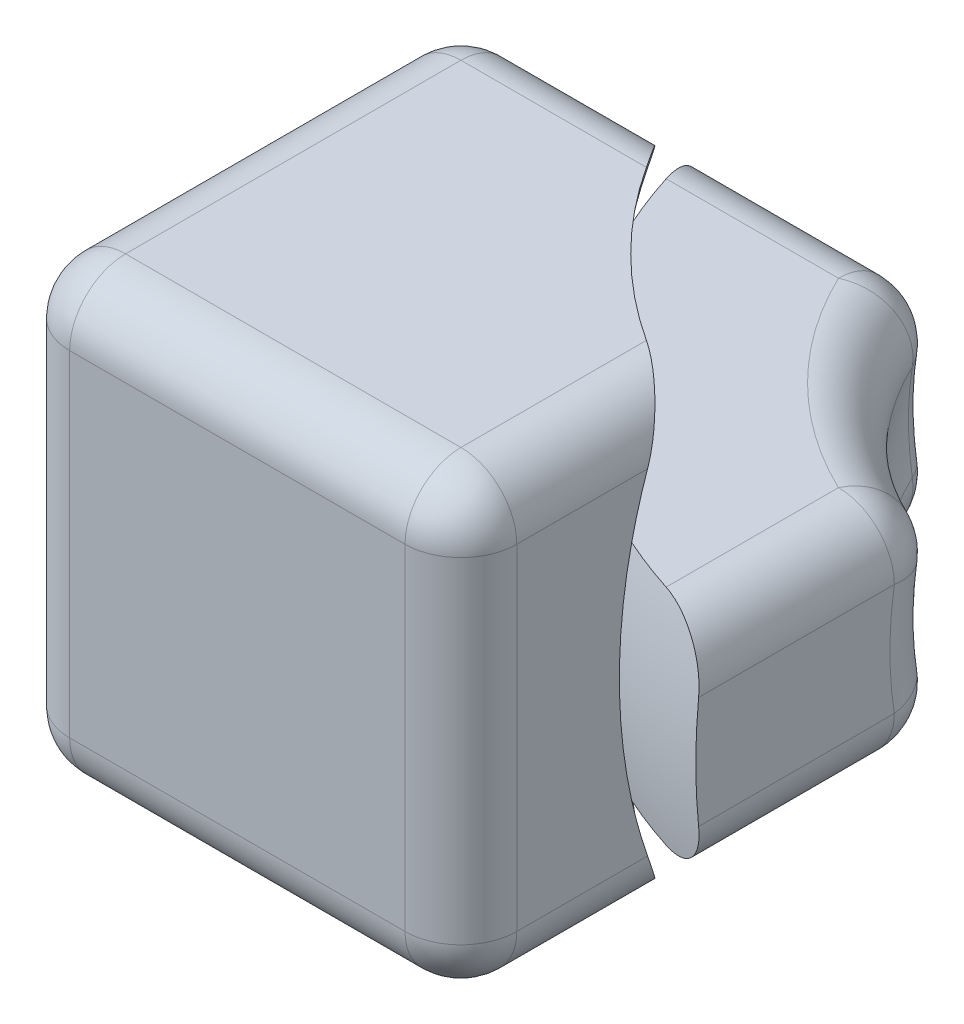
ISO-10303-21;
HEADER;
FILE_DESCRIPTION(('STEP AP214'),'2;1');
FILE_NAME('part.step','',(''),(''),'','','');
FILE_SCHEMA(('AUTOMOTIVE_DESIGN { 1 0 10303 214 1 1 1 1 }'));
ENDSEC;
DATA;
#1=APPLICATION_CONTEXT('core data for automotive mechanical design processes');
#2=APPLICATION_PROTOCOL_DEFINITION('international standard','automotive_design',2000,#1);
#3=PRODUCT_CONTEXT('',#1,'mechanical');
#4=PRODUCT('Part','Part','',(#3));
#5=PRODUCT_RELATED_PRODUCT_CATEGORY('part','',(#4));
#6=PRODUCT_DEFINITION_FORMATION('','',#4);
#7=PRODUCT_DEFINITION_CONTEXT('part definition',#1,'design');
#8=PRODUCT_DEFINITION('design','',#6,#7);
#9=PRODUCT_DEFINITION_SHAPE('','',#8);
#10=(LENGTH_UNIT() NAMED_UNIT(*) SI_UNIT(.MILLI.,.METRE.));
#11=(NAMED_UNIT(*) PLANE_ANGLE_UNIT() SI_UNIT($,.RADIAN.));
#12=(NAMED_UNIT(*) SI_UNIT($,.STERADIAN.) SOLID_ANGLE_UNIT());
#13=UNCERTAINTY_MEASURE_WITH_UNIT(LENGTH_MEASURE(1.E-05),#10,'distance_accuracy_value','');
#14=(GEOMETRIC_REPRESENTATION_CONTEXT(3) GLOBAL_UNCERTAINTY_ASSIGNED_CONTEXT((#13)) GLOBAL_UNIT_ASSIGNED_CONTEXT((#10,
#11,#12)) REPRESENTATION_CONTEXT('',''));
#15=CARTESIAN_POINT('',(0.,0.,0.));
#16=DIRECTION('',(0.,0.,1.));
#17=DIRECTION('',(1.,0.,0.));
#18=AXIS2_PLACEMENT_3D('',#15,#16,#17);
#19=CARTESIAN_POINT('',(-24.8230287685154,-5.04741274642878E-06,-35.1769670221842));
#20=DIRECTION('',(-1.,0.,0.));
#21=DIRECTION('',(0.,-1.,0.));
#22=AXIS2_PLACEMENT_3D('',#19,#20,#21);
#23=PLANE('',#22);
#24=DIRECTION('',(0.,-1.,0.));
#25=VECTOR('',#24,1.);
#26=CARTESIAN_POINT('',(-24.8230287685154,-15.0000050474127,51.0730329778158));
#27=LINE('',#26,#25);
#28=CARTESIAN_POINT('',(-24.8230287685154,11.2499949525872,51.0730329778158));
#29=VERTEX_POINT('',#28);
#30=CARTESIAN_POINT('',(-24.8230287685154,-11.2500050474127,51.0730329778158));
#31=VERTEX_POINT('',#30);
#32=EDGE_CURVE('E336',#29,#31,#27,.T.);
#33=ORIENTED_EDGE('',*,*,#32,.T.);
#34=DIRECTION('',(0.,0.,1.));
#35=VECTOR('',#34,1.);
#36=CARTESIAN_POINT('',(-24.8230287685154,-11.2500050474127,-35.1769670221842));
#37=LINE('',#36,#35);
#38=CARTESIAN_POINT('',(-24.8230287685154,-11.2500050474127,42.2989856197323));
#39=VERTEX_POINT('',#38);
#40=EDGE_CURVE('E270',#31,#39,#37,.F.);
#41=ORIENTED_EDGE('',*,*,#40,.T.);
#42=CARTESIAN_POINT('',(-24.8230287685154,-5.04741274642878E-06,9.82303297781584));
#43=DIRECTION('',(-1.,0.,0.));
#44=DIRECTION('',(0.,-1.,0.));
#45=AXIS2_PLACEMENT_3D('',#42,#43,#44);
#46=CIRCLE('',#45,34.3693177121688);
#47=CARTESIAN_POINT('',(-24.8230287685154,-7.50000504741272,43.3640526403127));
#48=VERTEX_POINT('',#47);
#49=EDGE_CURVE('E256',#48,#39,#46,.F.);
#50=ORIENTED_EDGE('',*,*,#49,.F.);
#51=CARTESIAN_POINT('',(-24.8230287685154,-5.04741274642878E-06,9.82303297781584));
#52=DIRECTION('',(-1.,0.,0.));
#53=DIRECTION('',(0.,-1.,0.));
#54=AXIS2_PLACEMENT_3D('',#51,#52,#53);
#55=CIRCLE('',#54,34.3693177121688);
#56=CARTESIAN_POINT('',(-24.8230287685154,7.49999495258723,43.3640526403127));
#57=VERTEX_POINT('',#56);
#58=EDGE_CURVE('E268',#57,#48,#55,.F.);
#59=ORIENTED_EDGE('',*,*,#58,.F.);
#60=CARTESIAN_POINT('',(-24.8230287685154,-5.04741274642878E-06,9.82303297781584));
#61=DIRECTION('',(-1.,0.,0.));
#62=DIRECTION('',(0.,-1.,0.));
#63=AXIS2_PLACEMENT_3D('',#60,#61,#62);
#64=CIRCLE('',#63,34.3693177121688);
#65=CARTESIAN_POINT('',(-24.8230287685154,11.2499949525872,42.2989856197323));
#66=VERTEX_POINT('',#65);
#67=EDGE_CURVE('E697',#66,#57,#64,.F.);
#68=ORIENTED_EDGE('',*,*,#67,.F.);
#69=DIRECTION('',(0.,0.,1.));
#70=VECTOR('',#69,1.);
#71=CARTESIAN_POINT('',(-24.8230287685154,11.2499949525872,54.8230329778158));
#72=LINE('',#71,#70);
#73=EDGE_CURVE('E334',#66,#29,#72,.T.);
#74=ORIENTED_EDGE('',*,*,#73,.T.);
#75=EDGE_LOOP('',(#33,#41,#50,#59,#68,#74));
#76=FACE_BOUND('',#75,.T.);
#77=ADVANCED_FACE('F83',(#76),#23,.F.);
#78=CARTESIAN_POINT('',(-9.82302876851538,-15.0000050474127,24.8230329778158));
#79=DIRECTION('',(0.,0.,-1.));
#80=DIRECTION('',(-1.,0.,0.));
#81=AXIS2_PLACEMENT_3D('',#78,#79,#80);
#82=PLANE('',#81);
#83=CARTESIAN_POINT('',(-9.82302876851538,-5.04741274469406E-06,24.8230329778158));
#84=DIRECTION('',(0.,0.,-1.));
#85=DIRECTION('',(-1.,0.,0.));
#86=AXIS2_PLACEMENT_3D('',#83,#84,#85);
#87=CIRCLE('',#86,34.3693177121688);
#88=CARTESIAN_POINT('',(-43.3640484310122,-7.50000504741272,24.8230329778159));
#89=VERTEX_POINT('',#88);
#90=CARTESIAN_POINT('',(-42.2989814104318,-11.2500050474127,24.8230329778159));
#91=VERTEX_POINT('',#90);
#92=EDGE_CURVE('E259',#89,#91,#87,.F.);
#93=ORIENTED_EDGE('',*,*,#92,.T.);
#94=DIRECTION('',(-1.,0.,0.));
#95=VECTOR('',#94,1.);
#96=CARTESIAN_POINT('',(-54.8230287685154,-11.2500050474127,24.8230329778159));
#97=LINE('',#96,#95);
#98=CARTESIAN_POINT('',(-51.0730287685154,-11.2500050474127,24.8230329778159));
#99=VERTEX_POINT('',#98);
#100=EDGE_CURVE('E323',#91,#99,#97,.T.);
#101=ORIENTED_EDGE('',*,*,#100,.T.);
#102=DIRECTION('',(0.,1.,0.));
#103=VECTOR('',#102,1.);
#104=CARTESIAN_POINT('',(-51.0730287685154,14.9999949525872,24.8230329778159));
#105=LINE('',#104,#103);
#106=CARTESIAN_POINT('',(-51.0730287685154,11.2499949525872,24.8230329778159));
#107=VERTEX_POINT('',#106);
#108=EDGE_CURVE('E321',#99,#107,#105,.T.);
#109=ORIENTED_EDGE('',*,*,#108,.T.);
#110=DIRECTION('',(-1.,0.,0.));
#111=VECTOR('',#110,1.);
#112=CARTESIAN_POINT('',(-9.82302876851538,11.2499949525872,24.8230329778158));
#113=LINE('',#112,#111);
#114=CARTESIAN_POINT('',(-42.2989814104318,11.2499949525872,24.8230329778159));
#115=VERTEX_POINT('',#114);
#116=EDGE_CURVE('E319',#107,#115,#113,.F.);
#117=ORIENTED_EDGE('',*,*,#116,.T.);
#118=CARTESIAN_POINT('',(-9.82302876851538,-5.04741274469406E-06,24.8230329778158));
#119=DIRECTION('',(0.,0.,-1.));
#120=DIRECTION('',(-1.,0.,0.));
#121=AXIS2_PLACEMENT_3D('',#118,#119,#120);
#122=CIRCLE('',#121,34.3693177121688);
#123=CARTESIAN_POINT('',(-43.3640484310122,7.49999495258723,24.8230329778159));
#124=VERTEX_POINT('',#123);
#125=EDGE_CURVE('E693',#115,#124,#122,.F.);
#126=ORIENTED_EDGE('',*,*,#125,.T.);
#127=CARTESIAN_POINT('',(-9.82302876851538,-5.04741274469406E-06,24.8230329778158));
#128=DIRECTION('',(0.,0.,-1.));
#129=DIRECTION('',(-1.,0.,0.));
#130=AXIS2_PLACEMENT_3D('',#127,#128,#129);
#131=CIRCLE('',#130,34.3693177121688);
#132=EDGE_CURVE('E290',#124,#89,#131,.F.);
#133=ORIENTED_EDGE('',*,*,#132,.T.);
#134=EDGE_LOOP('',(#93,#101,#109,#117,#126,#133));
#135=FACE_BOUND('',#134,.T.);
#136=ADVANCED_FACE('F402',(#135),#82,.T.);
#137=CARTESIAN_POINT('',(-9.82302876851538,-5.04741274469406E-06,9.82303297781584));
#138=DIRECTION('',(0.,-1.,0.));
#139=DIRECTION('',(0.,0.,1.));
#140=AXIS2_PLACEMENT_3D('',#137,#138,#139);
#141=SPHERICAL_SURFACE('',#140,37.5);
#142=CARTESIAN_POINT('',(-9.82302876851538,-5.04741274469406E-06,17.3230329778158));
#143=DIRECTION('',(0.,0.,1.));
#144=DIRECTION('',(1.,0.,0.));
#145=AXIS2_PLACEMENT_3D('',#142,#143,#144);
#146=CIRCLE('',#145,36.7423461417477);
#147=CARTESIAN_POINT('',(-46.373507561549,3.74999495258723,17.3230329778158));
#148=VERTEX_POINT('',#147);
#149=CARTESIAN_POINT('',(-46.373507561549,-3.75000504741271,17.3230329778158));
#150=VERTEX_POINT('',#149);
#151=EDGE_CURVE('E517',#148,#150,#146,.T.);
#152=ORIENTED_EDGE('',*,*,#151,.T.);
#153=CARTESIAN_POINT('',(-46.373507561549,-3.75000504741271,17.3230329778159));
#154=CARTESIAN_POINT('',(-46.362767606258,-3.85472032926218,17.3230205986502));
#155=CARTESIAN_POINT('',(-46.3506812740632,-3.95928467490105,17.3274187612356));
#156=CARTESIAN_POINT('',(-46.3239389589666,-4.16732996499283,17.3448685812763));
#157=CARTESIAN_POINT('',(-46.3092836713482,-4.27081119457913,17.3579178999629));
#158=CARTESIAN_POINT('',(-46.2775614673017,-4.47570226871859,17.3924581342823));
#159=CARTESIAN_POINT('',(-46.2605008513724,-4.57711675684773,17.4139272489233));
#160=CARTESIAN_POINT('',(-46.2240878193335,-4.77741798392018,17.4650389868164));
#161=CARTESIAN_POINT('',(-46.2047353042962,-4.87630461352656,17.4946819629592));
#162=CARTESIAN_POINT('',(-46.1434838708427,-5.16804264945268,17.595407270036));
#163=CARTESIAN_POINT('',(-46.0983433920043,-5.35627868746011,17.678338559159));
#164=CARTESIAN_POINT('',(-46.0008220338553,-5.71525414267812,17.8727122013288));
#165=CARTESIAN_POINT('',(-45.9484381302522,-5.88598619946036,17.9841664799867));
#166=CARTESIAN_POINT('',(-45.8359408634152,-6.21158874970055,18.2363240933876));
#167=CARTESIAN_POINT('',(-45.7756239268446,-6.36571378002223,18.3778999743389));
#168=CARTESIAN_POINT('',(-45.6503754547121,-6.64758170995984,18.6835141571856));
#169=CARTESIAN_POINT('',(-45.585442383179,-6.77531577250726,18.8475599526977));
#170=CARTESIAN_POINT('',(-45.4494844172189,-7.00694117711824,19.2017427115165));
#171=CARTESIAN_POINT('',(-45.3783166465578,-7.10942554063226,19.3927448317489));
#172=CARTESIAN_POINT('',(-45.2346535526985,-7.27992538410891,19.7890365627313));
#173=CARTESIAN_POINT('',(-45.1621588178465,-7.34795577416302,19.9943199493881));
#174=CARTESIAN_POINT('',(-45.0410585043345,-7.43176028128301,20.3460159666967));
#175=CARTESIAN_POINT('',(-44.9922729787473,-7.45730570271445,20.490113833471));
#176=CARTESIAN_POINT('',(-44.8956511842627,-7.49142106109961,20.7803837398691));
#177=CARTESIAN_POINT('',(-44.8478136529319,-7.5000153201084,20.9265525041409));
#178=CARTESIAN_POINT('',(-44.8007002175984,-7.50000504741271,21.0730329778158));
#179=B_SPLINE_CURVE_WITH_KNOTS('',3,(#153,#154,#155,#156,#157,#158,#159,#160,#161,#162,#163,
#164,#165,#166,#167,#168,#169,#170,#171,#172,#173,#174,#175,#176,#177,#178),.UNSPECIFIED.,.F.,
.F.,(4,2,2,2,2,2,2,2,2,2,2,2,4),(0.,0.315672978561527,0.631260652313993,0.946036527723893,
1.26082599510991,1.8894729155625,2.51838310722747,3.16887739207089,3.81958914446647,
4.50096066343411,5.1820370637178,5.64393189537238,6.10516350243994),.UNSPECIFIED.);
#180=CARTESIAN_POINT('',(-44.8007002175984,-7.50000504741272,21.0730329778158));
#181=VERTEX_POINT('',#180);
#182=EDGE_CURVE('E413',#150,#181,#179,.T.);
#183=ORIENTED_EDGE('',*,*,#182,.T.);
#184=CARTESIAN_POINT('',(-9.82302876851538,-7.50000504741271,9.82303297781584));
#185=DIRECTION('',(0.,-1.,0.));
#186=DIRECTION('',(1.,0.,0.));
#187=AXIS2_PLACEMENT_3D('',#184,#185,#186);
#188=CIRCLE('',#187,36.7423461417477);
#189=EDGE_CURVE('E699',#89,#181,#188,.T.);
#190=ORIENTED_EDGE('',*,*,#189,.F.);
#191=ORIENTED_EDGE('',*,*,#132,.F.);
#192=CARTESIAN_POINT('',(-9.82302876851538,7.49999495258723,9.82303297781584));
#193=DIRECTION('',(0.,1.,0.));
#194=DIRECTION('',(-1.,0.,0.));
#195=AXIS2_PLACEMENT_3D('',#192,#193,#194);
#196=CIRCLE('',#195,36.7423461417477);
#197=CARTESIAN_POINT('',(-44.8007002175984,7.49999495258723,21.0730329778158));
#198=VERTEX_POINT('',#197);
#199=EDGE_CURVE('E279',#198,#124,#196,.T.);
#200=ORIENTED_EDGE('',*,*,#199,.F.);
#201=CARTESIAN_POINT('',(-44.8007002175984,7.49999495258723,21.0730329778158));
#202=CARTESIAN_POINT('',(-44.8365022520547,7.50000216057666,20.9617192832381));
#203=CARTESIAN_POINT('',(-44.8727334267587,7.4950387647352,20.8505538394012));
#204=CARTESIAN_POINT('',(-44.9457843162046,7.47530347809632,20.6293019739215));
#205=CARTESIAN_POINT('',(-44.9826039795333,7.46053243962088,20.5192154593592));
#206=CARTESIAN_POINT('',(-45.0565617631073,7.42131806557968,20.3009040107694));
#207=CARTESIAN_POINT('',(-45.0936998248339,7.39687647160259,20.1926787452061));
#208=CARTESIAN_POINT('',(-45.1680254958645,7.33852899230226,19.9788589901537));
#209=CARTESIAN_POINT('',(-45.2052131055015,7.3046230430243,19.8732645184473));
#210=CARTESIAN_POINT('',(-45.3164789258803,7.18900808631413,19.5614940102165));
#211=CARTESIAN_POINT('',(-45.3903034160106,7.09337888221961,19.3602031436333));
#212=CARTESIAN_POINT('',(-45.5350418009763,6.8674513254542,18.9769859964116));
#213=CARTESIAN_POINT('',(-45.6059564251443,6.73716172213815,18.7950548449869));
#214=CARTESIAN_POINT('',(-45.7083631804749,6.51879125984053,18.5414983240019));
#215=CARTESIAN_POINT('',(-45.7417649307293,6.44238216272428,18.4603689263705));
#216=CARTESIAN_POINT('',(-45.807089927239,6.28232736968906,18.3049624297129));
#217=CARTESIAN_POINT('',(-45.839013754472,6.19868455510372,18.2306826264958));
#218=CARTESIAN_POINT('',(-45.9011571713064,6.02464833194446,18.0895759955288));
#219=CARTESIAN_POINT('',(-45.931375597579,5.9342504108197,18.0227542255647));
#220=CARTESIAN_POINT('',(-45.9898288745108,5.74741191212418,17.8972683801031));
#221=CARTESIAN_POINT('',(-46.0180646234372,5.65097410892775,17.8386005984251));
#222=CARTESIAN_POINT('',(-46.0713492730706,5.45628592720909,17.7319335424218));
#223=CARTESIAN_POINT('',(-46.0964762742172,5.35822553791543,17.6836264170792));
#224=CARTESIAN_POINT('',(-46.1444584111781,5.15783452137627,17.5956119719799));
#225=CARTESIAN_POINT('',(-46.1673145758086,5.0555058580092,17.5559007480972));
#226=CARTESIAN_POINT('',(-46.2105425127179,4.84742201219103,17.4855266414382));
#227=CARTESIAN_POINT('',(-46.230917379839,4.74167131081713,17.4548524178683));
#228=CARTESIAN_POINT('',(-46.2690248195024,4.52747564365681,17.4028609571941));
#229=CARTESIAN_POINT('',(-46.2867586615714,4.41903200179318,17.3815392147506));
#230=CARTESIAN_POINT('',(-46.316888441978,4.21728113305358,17.3510885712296));
#231=CARTESIAN_POINT('',(-46.3296856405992,4.12423973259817,17.3405800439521));
#232=CARTESIAN_POINT('',(-46.353182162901,3.937504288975,17.3265533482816));
#233=CARTESIAN_POINT('',(-46.3638844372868,3.84381135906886,17.323025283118));
#234=CARTESIAN_POINT('',(-46.373507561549,3.74999495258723,17.3230329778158));
#235=B_SPLINE_CURVE_WITH_KNOTS('',3,(#201,#202,#203,#204,#205,#206,#207,#208,#209,#210,#211,
#212,#213,#214,#215,#216,#217,#218,#219,#220,#221,#222,#223,#224,#225,#226,#227,#228,#229,#230,
#231,#232,#233,#234),.UNSPECIFIED.,.F.,.F.,(4,2,2,2,2,2,2,2,2,2,2,2,2,2,2,2,4),(0.,
0.350666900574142,0.701303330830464,1.05187664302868,1.40245232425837,2.10319837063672,
2.80376769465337,3.152437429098,3.50096891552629,3.8497353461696,4.19834273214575,
4.5344100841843,4.87032447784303,5.20581550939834,5.54114474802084,5.82437823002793,
6.10720986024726),.UNSPECIFIED.);
#236=EDGE_CURVE('E407',#198,#148,#235,.T.);
#237=ORIENTED_EDGE('',*,*,#236,.T.);
#238=EDGE_LOOP('',(#152,#183,#190,#191,#200,#237));
#239=FACE_BOUND('',#238,.T.);
#240=ADVANCED_FACE('F399',(#239),#141,.T.);
#241=CARTESIAN_POINT('',(-9.82302876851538,-5.04741274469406E-06,9.82303297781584));
#242=DIRECTION('',(0.,-1.,0.));
#243=DIRECTION('',(0.,0.,1.));
#244=AXIS2_PLACEMENT_3D('',#241,#242,#243);
#245=SPHERICAL_SURFACE('',#244,22.5);
#246=CARTESIAN_POINT('',(-9.82302876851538,3.21428066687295,9.82303297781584));
#247=DIRECTION('',(0.,-1.,0.));
#248=DIRECTION('',(0.,0.,-1.));
#249=AXIS2_PLACEMENT_3D('',#246,#247,#248);
#250=CIRCLE('',#249,22.2692246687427);
#251=CARTESIAN_POINT('',(-29.8962366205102,3.21428066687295,19.465890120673));
#252=VERTEX_POINT('',#251);
#253=CARTESIAN_POINT('',(-19.4658859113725,3.21428066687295,29.8962408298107));
#254=VERTEX_POINT('',#253);
#255=EDGE_CURVE('E599',#252,#254,#250,.F.);
#256=ORIENTED_EDGE('',*,*,#255,.T.);
#257=CARTESIAN_POINT('',(-19.4658859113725,-5.04741274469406E-06,9.82303297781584));
#258=DIRECTION('',(1.,0.,0.));
#259=DIRECTION('',(0.,0.,-1.));
#260=AXIS2_PLACEMENT_3D('',#257,#258,#259);
#261=CIRCLE('',#260,20.3289278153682);
#262=CARTESIAN_POINT('',(-19.4658859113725,-3.21429076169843,29.8962408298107));
#263=VERTEX_POINT('',#262);
#264=EDGE_CURVE('E590',#254,#263,#261,.T.);
#265=ORIENTED_EDGE('',*,*,#264,.T.);
#266=CARTESIAN_POINT('',(-9.82302876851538,-3.21429076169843,9.82303297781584));
#267=DIRECTION('',(0.,1.,0.));
#268=DIRECTION('',(0.,0.,1.));
#269=AXIS2_PLACEMENT_3D('',#266,#267,#268);
#270=CIRCLE('',#269,22.2692246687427);
#271=CARTESIAN_POINT('',(-29.8962366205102,-3.21429076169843,19.465890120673));
#272=VERTEX_POINT('',#271);
#273=EDGE_CURVE('E594',#263,#272,#270,.F.);
#274=ORIENTED_EDGE('',*,*,#273,.T.);
#275=CARTESIAN_POINT('',(-9.82302876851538,-5.04741274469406E-06,19.465890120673));
#276=DIRECTION('',(0.,0.,-1.));
#277=DIRECTION('',(-1.,0.,0.));
#278=AXIS2_PLACEMENT_3D('',#275,#276,#277);
#279=CIRCLE('',#278,20.3289278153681);
#280=EDGE_CURVE('E597',#272,#252,#279,.T.);
#281=ORIENTED_EDGE('',*,*,#280,.T.);
#282=EDGE_LOOP('',(#256,#265,#274,#281));
#283=FACE_BOUND('',#282,.T.);
#284=ADVANCED_FACE('F400',(#283),#245,.F.);
#285=CARTESIAN_POINT('',(-54.8230287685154,35.9687313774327,17.3230329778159));
#286=DIRECTION('',(0.,0.,1.));
#287=DIRECTION('',(1.,0.,0.));
#288=AXIS2_PLACEMENT_3D('',#285,#286,#287);
#289=PLANE('',#288);
#290=CARTESIAN_POINT('',(-9.82302876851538,-5.04741274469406E-06,17.3230329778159));
#291=DIRECTION('',(0.,0.,1.));
#292=DIRECTION('',(1.,0.,0.));
#293=AXIS2_PLACEMENT_3D('',#290,#291,#292);
#294=CIRCLE('',#293,23.7170824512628);
#295=CARTESIAN_POINT('',(-33.2417712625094,3.74999495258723,17.3230329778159));
#296=VERTEX_POINT('',#295);
#297=CARTESIAN_POINT('',(-33.2417712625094,-3.75000504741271,17.3230329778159));
#298=VERTEX_POINT('',#297);
#299=EDGE_CURVE('E535',#296,#298,#294,.T.);
#300=ORIENTED_EDGE('',*,*,#299,.T.);
#301=DIRECTION('',(1.,0.,0.));
#302=VECTOR('',#301,1.);
#303=CARTESIAN_POINT('',(-54.8230287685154,-3.75000504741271,17.3230329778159));
#304=LINE('',#303,#302);
#305=EDGE_CURVE('E537',#298,#150,#304,.F.);
#306=ORIENTED_EDGE('',*,*,#305,.T.);
#307=ORIENTED_EDGE('',*,*,#151,.F.);
#308=DIRECTION('',(-1.,0.,0.));
#309=VECTOR('',#308,1.);
#310=CARTESIAN_POINT('',(-54.8230287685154,3.74999495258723,17.3230329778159));
#311=LINE('',#310,#309);
#312=EDGE_CURVE('E533',#148,#296,#311,.F.);
#313=ORIENTED_EDGE('',*,*,#312,.T.);
#314=EDGE_LOOP('',(#300,#306,#307,#313));
#315=FACE_BOUND('',#314,.T.);
#316=ADVANCED_FACE('F500',(#315),#289,.F.);
#317=CARTESIAN_POINT('',(-9.82302876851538,-15.0000050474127,-35.1769670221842));
#318=DIRECTION('',(0.,1.,0.));
#319=DIRECTION('',(-1.,0.,0.));
#320=AXIS2_PLACEMENT_3D('',#317,#318,#319);
#321=PLANE('',#320);
#322=DIRECTION('',(0.,0.,1.));
#323=VECTOR('',#322,1.);
#324=CARTESIAN_POINT('',(-28.5730287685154,-15.0000050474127,-35.1769670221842));
#325=LINE('',#324,#323);
#326=CARTESIAN_POINT('',(-28.5730287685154,-15.0000050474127,38.6273295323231));
#327=VERTEX_POINT('',#326);
#328=CARTESIAN_POINT('',(-28.5730287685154,-15.0000050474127,51.0730329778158));
#329=VERTEX_POINT('',#328);
#330=EDGE_CURVE('E311',#327,#329,#325,.T.);
#331=ORIENTED_EDGE('',*,*,#330,.T.);
#332=DIRECTION('',(-1.,0.,0.));
#333=VECTOR('',#332,1.);
#334=CARTESIAN_POINT('',(-54.8230287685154,-15.0000050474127,51.0730329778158));
#335=LINE('',#334,#333);
#336=CARTESIAN_POINT('',(-51.0730287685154,-15.0000050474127,51.0730329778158));
#337=VERTEX_POINT('',#336);
#338=EDGE_CURVE('E313',#329,#337,#335,.T.);
#339=ORIENTED_EDGE('',*,*,#338,.T.);
#340=DIRECTION('',(0.,0.,1.));
#341=VECTOR('',#340,1.);
#342=CARTESIAN_POINT('',(-51.0730287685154,-15.0000050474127,-35.1769670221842));
#343=LINE('',#342,#341);
#344=CARTESIAN_POINT('',(-51.0730287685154,-15.0000050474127,28.5730329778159));
#345=VERTEX_POINT('',#344);
#346=EDGE_CURVE('E315',#337,#345,#343,.F.);
#347=ORIENTED_EDGE('',*,*,#346,.T.);
#348=DIRECTION('',(-1.,0.,0.));
#349=VECTOR('',#348,1.);
#350=CARTESIAN_POINT('',(-40.7463209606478,-15.0000050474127,28.5730329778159));
#351=LINE('',#350,#349);
#352=CARTESIAN_POINT('',(-38.6273253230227,-15.0000050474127,28.5730329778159));
#353=VERTEX_POINT('',#352);
#354=EDGE_CURVE('E317',#345,#353,#351,.F.);
#355=ORIENTED_EDGE('',*,*,#354,.T.);
#356=CARTESIAN_POINT('',(-9.82302876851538,-15.0000050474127,9.82303297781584));
#357=DIRECTION('',(0.,1.,0.));
#358=DIRECTION('',(-1.,0.,0.));
#359=AXIS2_PLACEMENT_3D('',#356,#357,#358);
#360=CIRCLE('',#359,34.3693177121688);
#361=EDGE_CURVE('E284',#327,#353,#360,.F.);
#362=ORIENTED_EDGE('',*,*,#361,.F.);
#363=EDGE_LOOP('',(#331,#339,#347,#355,#362));
#364=FACE_BOUND('',#363,.T.);
#365=ADVANCED_FACE('F442',(#364),#321,.F.);
#366=CARTESIAN_POINT('',(-9.82302876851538,14.9999949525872,-35.1769670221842));
#367=DIRECTION('',(0.,1.,0.));
#368=DIRECTION('',(-1.,0.,0.));
#369=AXIS2_PLACEMENT_3D('',#366,#367,#368);
#370=PLANE('',#369);
#371=DIRECTION('',(-1.,0.,0.));
#372=VECTOR('',#371,1.);
#373=CARTESIAN_POINT('',(-9.82302876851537,14.9999949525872,28.5730329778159));
#374=LINE('',#373,#372);
#375=CARTESIAN_POINT('',(-38.6273253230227,14.9999949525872,28.5730329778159));
#376=VERTEX_POINT('',#375);
#377=CARTESIAN_POINT('',(-51.0730287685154,14.9999949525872,28.5730329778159));
#378=VERTEX_POINT('',#377);
#379=EDGE_CURVE('E287',#376,#378,#374,.T.);
#380=ORIENTED_EDGE('',*,*,#379,.T.);
#381=DIRECTION('',(0.,0.,1.));
#382=VECTOR('',#381,1.);
#383=CARTESIAN_POINT('',(-51.0730287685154,14.9999949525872,54.8230329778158));
#384=LINE('',#383,#382);
#385=CARTESIAN_POINT('',(-51.0730287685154,14.9999949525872,51.0730329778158));
#386=VERTEX_POINT('',#385);
#387=EDGE_CURVE('E295',#378,#386,#384,.T.);
#388=ORIENTED_EDGE('',*,*,#387,.T.);
#389=DIRECTION('',(-1.,0.,0.));
#390=VECTOR('',#389,1.);
#391=CARTESIAN_POINT('',(-9.82302876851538,14.9999949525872,51.0730329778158));
#392=LINE('',#391,#390);
#393=CARTESIAN_POINT('',(-28.5730287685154,14.9999949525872,51.0730329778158));
#394=VERTEX_POINT('',#393);
#395=EDGE_CURVE('E298',#386,#394,#392,.F.);
#396=ORIENTED_EDGE('',*,*,#395,.T.);
#397=DIRECTION('',(0.,0.,1.));
#398=VECTOR('',#397,1.);
#399=CARTESIAN_POINT('',(-28.5730287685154,14.9999949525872,40.7463251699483));
#400=LINE('',#399,#398);
#401=CARTESIAN_POINT('',(-28.5730287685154,14.9999949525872,38.6273295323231));
#402=VERTEX_POINT('',#401);
#403=EDGE_CURVE('E300',#394,#402,#400,.F.);
#404=ORIENTED_EDGE('',*,*,#403,.T.);
#405=CARTESIAN_POINT('',(-9.82302876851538,14.9999949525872,9.82303297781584));
#406=DIRECTION('',(0.,1.,0.));
#407=DIRECTION('',(-1.,0.,0.));
#408=AXIS2_PLACEMENT_3D('',#405,#406,#407);
#409=CIRCLE('',#408,34.3693177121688);
#410=EDGE_CURVE('E285',#402,#376,#409,.F.);
#411=ORIENTED_EDGE('',*,*,#410,.T.);
#412=EDGE_LOOP('',(#380,#388,#396,#404,#411));
#413=FACE_BOUND('',#412,.T.);
#414=ADVANCED_FACE('F449',(#413),#370,.T.);
#415=CARTESIAN_POINT('',(-54.8230287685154,-45.0000050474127,54.8230329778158));
#416=DIRECTION('',(1.,0.,0.));
#417=DIRECTION('',(0.,1.,0.));
#418=AXIS2_PLACEMENT_3D('',#415,#416,#417);
#419=PLANE('',#418);
#420=DIRECTION('',(0.,0.,1.));
#421=VECTOR('',#420,1.);
#422=CARTESIAN_POINT('',(-54.8230287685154,11.2499949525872,24.8230329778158));
#423=LINE('',#422,#421);
#424=CARTESIAN_POINT('',(-54.8230287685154,11.2499949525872,51.0730329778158));
#425=VERTEX_POINT('',#424);
#426=CARTESIAN_POINT('',(-54.8230287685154,11.2499949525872,28.5730329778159));
#427=VERTEX_POINT('',#426);
#428=EDGE_CURVE('E306',#425,#427,#423,.F.);
#429=ORIENTED_EDGE('',*,*,#428,.T.);
#430=DIRECTION('',(0.,1.,0.));
#431=VECTOR('',#430,1.);
#432=CARTESIAN_POINT('',(-54.8230287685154,-15.0000050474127,28.5730329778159));
#433=LINE('',#432,#431);
#434=CARTESIAN_POINT('',(-54.8230287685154,-11.2500050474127,28.5730329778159));
#435=VERTEX_POINT('',#434);
#436=EDGE_CURVE('E309',#427,#435,#433,.F.);
#437=ORIENTED_EDGE('',*,*,#436,.T.);
#438=DIRECTION('',(0.,0.,1.));
#439=VECTOR('',#438,1.);
#440=CARTESIAN_POINT('',(-54.8230287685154,-11.2500050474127,54.8230329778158));
#441=LINE('',#440,#439);
#442=CARTESIAN_POINT('',(-54.8230287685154,-11.2500050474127,51.0730329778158));
#443=VERTEX_POINT('',#442);
#444=EDGE_CURVE('E304',#435,#443,#441,.T.);
#445=ORIENTED_EDGE('',*,*,#444,.T.);
#446=DIRECTION('',(0.,-1.,0.));
#447=VECTOR('',#446,1.);
#448=CARTESIAN_POINT('',(-54.8230287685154,14.9999949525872,51.0730329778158));
#449=LINE('',#448,#447);
#450=EDGE_CURVE('E302',#443,#425,#449,.F.);
#451=ORIENTED_EDGE('',*,*,#450,.T.);
#452=EDGE_LOOP('',(#429,#437,#445,#451));
#453=FACE_BOUND('',#452,.T.);
#454=ADVANCED_FACE('F445',(#453),#419,.F.);
#455=CARTESIAN_POINT('',(-9.82302876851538,-5.04741274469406E-06,54.8230329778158));
#456=DIRECTION('',(0.,0.,1.));
#457=DIRECTION('',(1.,0.,0.));
#458=AXIS2_PLACEMENT_3D('',#455,#456,#457);
#459=PLANE('',#458);
#460=DIRECTION('',(-1.,0.,0.));
#461=VECTOR('',#460,1.);
#462=CARTESIAN_POINT('',(-9.82302876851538,11.2499949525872,54.8230329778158));
#463=LINE('',#462,#461);
#464=CARTESIAN_POINT('',(-28.5730287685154,11.2499949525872,54.8230329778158));
#465=VERTEX_POINT('',#464);
#466=CARTESIAN_POINT('',(-51.0730287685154,11.2499949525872,54.8230329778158));
#467=VERTEX_POINT('',#466);
#468=EDGE_CURVE('E329',#465,#467,#463,.T.);
#469=ORIENTED_EDGE('',*,*,#468,.T.);
#470=DIRECTION('',(0.,-1.,0.));
#471=VECTOR('',#470,1.);
#472=CARTESIAN_POINT('',(-51.0730287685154,-15.0000050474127,54.8230329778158));
#473=LINE('',#472,#471);
#474=CARTESIAN_POINT('',(-51.0730287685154,-11.2500050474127,54.8230329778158));
#475=VERTEX_POINT('',#474);
#476=EDGE_CURVE('E331',#467,#475,#473,.T.);
#477=ORIENTED_EDGE('',*,*,#476,.T.);
#478=DIRECTION('',(-1.,0.,0.));
#479=VECTOR('',#478,1.);
#480=CARTESIAN_POINT('',(-24.8230287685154,-11.2500050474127,54.8230329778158));
#481=LINE('',#480,#479);
#482=CARTESIAN_POINT('',(-28.5730287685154,-11.2500050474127,54.8230329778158));
#483=VERTEX_POINT('',#482);
#484=EDGE_CURVE('E325',#475,#483,#481,.F.);
#485=ORIENTED_EDGE('',*,*,#484,.T.);
#486=DIRECTION('',(0.,-1.,0.));
#487=VECTOR('',#486,1.);
#488=CARTESIAN_POINT('',(-28.5730287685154,14.9999949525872,54.8230329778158));
#489=LINE('',#488,#487);
#490=EDGE_CURVE('E327',#483,#465,#489,.F.);
#491=ORIENTED_EDGE('',*,*,#490,.T.);
#492=EDGE_LOOP('',(#469,#477,#485,#491));
#493=FACE_BOUND('',#492,.T.);
#494=ADVANCED_FACE('F398',(#493),#459,.T.);
#495=CARTESIAN_POINT('',(-9.82302876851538,-7.50000504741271,9.82303297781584));
#496=DIRECTION('',(0.,1.,0.));
#497=DIRECTION('',(0.,0.,1.));
#498=AXIS2_PLACEMENT_3D('',#495,#496,#497);
#499=CIRCLE('',#498,36.7423461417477);
#500=CARTESIAN_POINT('',(-21.0730287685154,-7.50000504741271,44.8007044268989));
#501=VERTEX_POINT('',#500);
#502=EDGE_CURVE('E273',#48,#501,#499,.T.);
#503=ORIENTED_EDGE('',*,*,#502,.T.);
#504=CARTESIAN_POINT('',(-21.0730287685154,-7.50000504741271,44.8007044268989));
#505=CARTESIAN_POINT('',(-20.9617150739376,-7.50001225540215,44.8365064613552));
#506=CARTESIAN_POINT('',(-20.8505496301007,-7.49504885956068,44.8727376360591));
#507=CARTESIAN_POINT('',(-20.629297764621,-7.4753135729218,44.945788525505));
#508=CARTESIAN_POINT('',(-20.5192112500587,-7.46054253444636,44.9826081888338));
#509=CARTESIAN_POINT('',(-20.3008998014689,-7.42132816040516,45.0565659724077));
#510=CARTESIAN_POINT('',(-20.1926745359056,-7.39688656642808,45.0937040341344));
#511=CARTESIAN_POINT('',(-19.9788547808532,-7.33853908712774,45.168029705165));
#512=CARTESIAN_POINT('',(-19.8732603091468,-7.30463313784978,45.2052173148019));
#513=CARTESIAN_POINT('',(-19.561489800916,-7.18901818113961,45.3164831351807));
#514=CARTESIAN_POINT('',(-19.3601989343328,-7.09338897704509,45.3903076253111));
#515=CARTESIAN_POINT('',(-18.9769817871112,-6.86746142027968,45.5350460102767));
#516=CARTESIAN_POINT('',(-18.7950506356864,-6.73717181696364,45.6059606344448));
#517=CARTESIAN_POINT('',(-18.5414941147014,-6.51880135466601,45.7083673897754));
#518=CARTESIAN_POINT('',(-18.46036471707,-6.44239225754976,45.7417691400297));
#519=CARTESIAN_POINT('',(-18.3049582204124,-6.28233746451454,45.8070941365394));
#520=CARTESIAN_POINT('',(-18.2306784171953,-6.19869464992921,45.8390179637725));
#521=CARTESIAN_POINT('',(-18.0895717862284,-6.02465842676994,45.9011613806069));
#522=CARTESIAN_POINT('',(-18.0227500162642,-5.93426050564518,45.9313798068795));
#523=CARTESIAN_POINT('',(-17.8972641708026,-5.74742200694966,45.9898330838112));
#524=CARTESIAN_POINT('',(-17.8385963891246,-5.65098420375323,46.0180688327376));
#525=CARTESIAN_POINT('',(-17.7319293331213,-5.45629602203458,46.0713534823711));
#526=CARTESIAN_POINT('',(-17.6836222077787,-5.35823563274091,46.0964804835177));
#527=CARTESIAN_POINT('',(-17.5956077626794,-5.15784461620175,46.1444626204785));
#528=CARTESIAN_POINT('',(-17.5558965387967,-5.05551595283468,46.1673187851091));
#529=CARTESIAN_POINT('',(-17.4855224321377,-4.84743210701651,46.2105467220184));
#530=CARTESIAN_POINT('',(-17.4548482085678,-4.7416814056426,46.2309215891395));
#531=CARTESIAN_POINT('',(-17.4028567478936,-4.52748573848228,46.2690290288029));
#532=CARTESIAN_POINT('',(-17.3815350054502,-4.41904209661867,46.2867628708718));
#533=CARTESIAN_POINT('',(-17.3510843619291,-4.21729122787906,46.3168926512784));
#534=CARTESIAN_POINT('',(-17.3405758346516,-4.12424982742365,46.3296898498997));
#535=CARTESIAN_POINT('',(-17.3265491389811,-3.93751438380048,46.3531863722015));
#536=CARTESIAN_POINT('',(-17.3230210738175,-3.84382145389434,46.3638886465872));
#537=CARTESIAN_POINT('',(-17.3230287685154,-3.75000504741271,46.3735117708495));
#538=B_SPLINE_CURVE_WITH_KNOTS('',3,(#504,#505,#506,#507,#508,#509,#510,#511,#512,#513,#514,
#515,#516,#517,#518,#519,#520,#521,#522,#523,#524,#525,#526,#527,#528,#529,#530,#531,#532,#533,
#534,#535,#536,#537),.UNSPECIFIED.,.F.,.F.,(4,2,2,2,2,2,2,2,2,2,2,2,2,2,2,2,4),(0.,
0.35066690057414,0.701303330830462,1.05187664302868,1.40245232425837,2.10319837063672,
2.80376769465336,3.15243742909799,3.50096891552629,3.8497353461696,4.19834273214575,
4.5344100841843,4.87032447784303,5.20581550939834,5.54114474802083,5.82437823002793,
6.10720986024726),.UNSPECIFIED.);
#539=CARTESIAN_POINT('',(-17.3230287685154,-3.75000504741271,46.3735117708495));
#540=VERTEX_POINT('',#539);
#541=EDGE_CURVE('E12',#501,#540,#538,.T.);
#542=ORIENTED_EDGE('',*,*,#541,.T.);
#543=CARTESIAN_POINT('',(-17.3230287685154,-5.04741274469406E-06,9.82303297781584));
#544=DIRECTION('',(-1.,0.,0.));
#545=DIRECTION('',(0.,0.,1.));
#546=AXIS2_PLACEMENT_3D('',#543,#544,#545);
#547=CIRCLE('',#546,36.7423461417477);
#548=CARTESIAN_POINT('',(-17.3230287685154,3.74999495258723,46.3735117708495));
#549=VERTEX_POINT('',#548);
#550=EDGE_CURVE('E509',#540,#549,#547,.T.);
#551=ORIENTED_EDGE('',*,*,#550,.T.);
#552=CARTESIAN_POINT('',(-17.3230287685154,3.74999495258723,46.3735117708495));
#553=CARTESIAN_POINT('',(-17.3230163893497,3.85471023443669,46.3627718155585));
#554=CARTESIAN_POINT('',(-17.3274145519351,3.95927458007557,46.3506854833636));
#555=CARTESIAN_POINT('',(-17.3448643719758,4.16731987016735,46.323943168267));
#556=CARTESIAN_POINT('',(-17.3579136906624,4.27080109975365,46.3092878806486));
#557=CARTESIAN_POINT('',(-17.3924539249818,4.4756921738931,46.2775656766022));
#558=CARTESIAN_POINT('',(-17.4139230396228,4.57710666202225,46.2605050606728));
#559=CARTESIAN_POINT('',(-17.4650347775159,4.7774078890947,46.224092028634));
#560=CARTESIAN_POINT('',(-17.4946777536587,4.87629451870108,46.2047395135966));
#561=CARTESIAN_POINT('',(-17.5954030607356,5.1680325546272,46.1434880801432));
#562=CARTESIAN_POINT('',(-17.6783343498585,5.35626859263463,46.0983476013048));
#563=CARTESIAN_POINT('',(-17.8727079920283,5.71524404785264,46.0008262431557));
#564=CARTESIAN_POINT('',(-17.9841622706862,5.88597610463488,45.9484423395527));
#565=CARTESIAN_POINT('',(-18.2363198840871,6.21157865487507,45.8359450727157));
#566=CARTESIAN_POINT('',(-18.3778957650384,6.36570368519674,45.7756281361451));
#567=CARTESIAN_POINT('',(-18.6835099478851,6.64757161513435,45.6503796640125));
#568=CARTESIAN_POINT('',(-18.8475557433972,6.77530567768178,45.5854465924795));
#569=CARTESIAN_POINT('',(-19.201738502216,7.00693108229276,45.4494886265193));
#570=CARTESIAN_POINT('',(-19.3927406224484,7.10941544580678,45.3783208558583));
#571=CARTESIAN_POINT('',(-19.7890323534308,7.27991528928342,45.2346577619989));
#572=CARTESIAN_POINT('',(-19.9943157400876,7.34794567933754,45.1621630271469));
#573=CARTESIAN_POINT('',(-20.3460117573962,7.43175018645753,45.041062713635));
#574=CARTESIAN_POINT('',(-20.4901096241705,7.45729560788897,44.9922771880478));
#575=CARTESIAN_POINT('',(-20.7803795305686,7.49141096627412,44.8956553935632));
#576=CARTESIAN_POINT('',(-20.9265482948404,7.50000522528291,44.8478178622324));
#577=CARTESIAN_POINT('',(-21.0730287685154,7.49999495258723,44.8007044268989));
#578=B_SPLINE_CURVE_WITH_KNOTS('',3,(#552,#553,#554,#555,#556,#557,#558,#559,#560,#561,#562,
#563,#564,#565,#566,#567,#568,#569,#570,#571,#572,#573,#574,#575,#576,#577),.UNSPECIFIED.,.F.,
.F.,(4,2,2,2,2,2,2,2,2,2,2,2,4),(0.,0.315672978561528,0.631260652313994,0.946036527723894,
1.26082599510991,1.8894729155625,2.51838310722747,3.16887739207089,3.81958914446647,
4.50096066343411,5.1820370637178,5.64393189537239,6.10516350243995),.UNSPECIFIED.);
#579=CARTESIAN_POINT('',(-21.0730287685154,7.49999495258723,44.8007044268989));
#580=VERTEX_POINT('',#579);
#581=EDGE_CURVE('E93',#549,#580,#578,.T.);
#582=ORIENTED_EDGE('',*,*,#581,.T.);
#583=CARTESIAN_POINT('',(-9.82302876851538,7.49999495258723,9.82303297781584));
#584=DIRECTION('',(0.,-1.,0.));
#585=DIRECTION('',(0.,0.,-1.));
#586=AXIS2_PLACEMENT_3D('',#583,#584,#585);
#587=CIRCLE('',#586,36.7423461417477);
#588=EDGE_CURVE('E278',#580,#57,#587,.T.);
#589=ORIENTED_EDGE('',*,*,#588,.T.);
#590=ORIENTED_EDGE('',*,*,#58,.T.);
#591=EDGE_LOOP('',(#503,#542,#551,#582,#589,#590));
#592=FACE_BOUND('',#591,.T.);
#593=ADVANCED_FACE('F281',(#592),#141,.T.);
#594=CARTESIAN_POINT('',(-17.3230287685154,36.7423410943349,-27.6769670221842));
#595=DIRECTION('',(-1.,0.,0.));
#596=DIRECTION('',(0.,0.,1.));
#597=AXIS2_PLACEMENT_3D('',#594,#595,#596);
#598=PLANE('',#597);
#599=ORIENTED_EDGE('',*,*,#550,.F.);
#600=DIRECTION('',(0.,0.,-1.));
#601=VECTOR('',#600,1.);
#602=CARTESIAN_POINT('',(-17.3230287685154,-3.75000504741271,-27.6769670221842));
#603=LINE('',#602,#601);
#604=CARTESIAN_POINT('',(-17.3230287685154,-3.75000504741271,33.2417754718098));
#605=VERTEX_POINT('',#604);
#606=EDGE_CURVE('E512',#540,#605,#603,.T.);
#607=ORIENTED_EDGE('',*,*,#606,.T.);
#608=CARTESIAN_POINT('',(-17.3230287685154,-5.04741274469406E-06,9.82303297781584));
#609=DIRECTION('',(-1.,0.,0.));
#610=DIRECTION('',(0.,0.,1.));
#611=AXIS2_PLACEMENT_3D('',#608,#609,#610);
#612=CIRCLE('',#611,23.7170824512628);
#613=CARTESIAN_POINT('',(-17.3230287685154,3.74999495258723,33.2417754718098));
#614=VERTEX_POINT('',#613);
#615=EDGE_CURVE('E523',#605,#614,#612,.T.);
#616=ORIENTED_EDGE('',*,*,#615,.T.);
#617=DIRECTION('',(0.,0.,1.));
#618=VECTOR('',#617,1.);
#619=CARTESIAN_POINT('',(-17.3230287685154,3.74999495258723,-27.6769670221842));
#620=LINE('',#619,#618);
#621=EDGE_CURVE('E515',#614,#549,#620,.T.);
#622=ORIENTED_EDGE('',*,*,#621,.T.);
#623=EDGE_LOOP('',(#599,#607,#616,#622));
#624=FACE_BOUND('',#623,.T.);
#625=ADVANCED_FACE('F397',(#624),#598,.F.);
#626=CARTESIAN_POINT('',(-65.0839019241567,7.49999495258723,45.7917694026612));
#627=DIRECTION('',(0.,-1.,0.));
#628=DIRECTION('',(0.,0.,-1.));
#629=AXIS2_PLACEMENT_3D('',#626,#627,#628);
#630=PLANE('',#629);
#631=CARTESIAN_POINT('',(-9.82302876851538,7.49999495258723,9.82303297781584));
#632=DIRECTION('',(0.,-1.,0.));
#633=DIRECTION('',(0.,0.,-1.));
#634=AXIS2_PLACEMENT_3D('',#631,#632,#633);
#635=CIRCLE('',#634,25.9807621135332);
#636=CARTESIAN_POINT('',(-21.0730287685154,7.49999495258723,33.2417754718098));
#637=VERTEX_POINT('',#636);
#638=CARTESIAN_POINT('',(-33.2417712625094,7.49999495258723,21.0730329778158));
#639=VERTEX_POINT('',#638);
#640=EDGE_CURVE('E525',#637,#639,#635,.T.);
#641=ORIENTED_EDGE('',*,*,#640,.T.);
#642=DIRECTION('',(-1.,0.,0.));
#643=VECTOR('',#642,1.);
#644=CARTESIAN_POINT('',(-65.0839019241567,7.49999495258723,21.0730329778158));
#645=LINE('',#644,#643);
#646=EDGE_CURVE('E531',#639,#198,#645,.T.);
#647=ORIENTED_EDGE('',*,*,#646,.T.);
#648=ORIENTED_EDGE('',*,*,#199,.T.);
#649=CARTESIAN_POINT('',(-9.82302876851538,7.49999495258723,9.82303297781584));
#650=DIRECTION('',(0.,-1.,0.));
#651=DIRECTION('',(0.,0.,-1.));
#652=AXIS2_PLACEMENT_3D('',#649,#650,#651);
#653=CIRCLE('',#652,36.7423461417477);
#654=EDGE_CURVE('E695',#57,#124,#653,.T.);
#655=ORIENTED_EDGE('',*,*,#654,.F.);
#656=ORIENTED_EDGE('',*,*,#588,.F.);
#657=DIRECTION('',(0.,0.,1.));
#658=VECTOR('',#657,1.);
#659=CARTESIAN_POINT('',(-21.0730287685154,7.49999495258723,45.7917694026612));
#660=LINE('',#659,#658);
#661=EDGE_CURVE('E522',#580,#637,#660,.F.);
#662=ORIENTED_EDGE('',*,*,#661,.T.);
#663=EDGE_LOOP('',(#641,#647,#648,#655,#656,#662));
#664=FACE_BOUND('',#663,.T.);
#665=ADVANCED_FACE('F496',(#664),#630,.F.);
#666=CARTESIAN_POINT('',(-65.0839019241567,-7.50000504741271,45.7917694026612));
#667=DIRECTION('',(0.,1.,0.));
#668=DIRECTION('',(0.,0.,1.));
#669=AXIS2_PLACEMENT_3D('',#666,#667,#668);
#670=PLANE('',#669);
#671=ORIENTED_EDGE('',*,*,#189,.T.);
#672=DIRECTION('',(1.,0.,0.));
#673=VECTOR('',#672,1.);
#674=CARTESIAN_POINT('',(-65.0839019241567,-7.50000504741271,21.0730329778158));
#675=LINE('',#674,#673);
#676=CARTESIAN_POINT('',(-33.2417712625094,-7.50000504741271,21.0730329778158));
#677=VERTEX_POINT('',#676);
#678=EDGE_CURVE('E101',#181,#677,#675,.T.);
#679=ORIENTED_EDGE('',*,*,#678,.T.);
#680=CARTESIAN_POINT('',(-9.82302876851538,-7.50000504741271,9.82303297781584));
#681=DIRECTION('',(0.,1.,0.));
#682=DIRECTION('',(0.,0.,1.));
#683=AXIS2_PLACEMENT_3D('',#680,#681,#682);
#684=CIRCLE('',#683,25.9807621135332);
#685=CARTESIAN_POINT('',(-21.0730287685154,-7.50000504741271,33.2417754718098));
#686=VERTEX_POINT('',#685);
#687=EDGE_CURVE('E106',#677,#686,#684,.T.);
#688=ORIENTED_EDGE('',*,*,#687,.T.);
#689=DIRECTION('',(0.,0.,-1.));
#690=VECTOR('',#689,1.);
#691=CARTESIAN_POINT('',(-21.0730287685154,-7.50000504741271,45.7917694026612));
#692=LINE('',#691,#690);
#693=EDGE_CURVE('E275',#686,#501,#692,.F.);
#694=ORIENTED_EDGE('',*,*,#693,.T.);
#695=ORIENTED_EDGE('',*,*,#502,.F.);
#696=CARTESIAN_POINT('',(-9.82302876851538,-7.50000504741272,9.82303297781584));
#697=DIRECTION('',(0.,-1.,0.));
#698=DIRECTION('',(0.,0.,-1.));
#699=AXIS2_PLACEMENT_3D('',#696,#697,#698);
#700=CIRCLE('',#699,36.7423461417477);
#701=EDGE_CURVE('E252',#48,#89,#700,.T.);
#702=ORIENTED_EDGE('',*,*,#701,.T.);
#703=EDGE_LOOP('',(#671,#679,#688,#694,#695,#702));
#704=FACE_BOUND('',#703,.T.);
#705=ADVANCED_FACE('F274',(#704),#670,.F.);
#706=CARTESIAN_POINT('',(-9.82302876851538,-5.04741274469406E-06,9.82303297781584));
#707=DIRECTION('',(0.,-1.,0.));
#708=DIRECTION('',(-1.,0.,0.));
#709=AXIS2_PLACEMENT_3D('',#706,#707,#708);
#710=SPHERICAL_SURFACE('',#709,37.5);
#711=ORIENTED_EDGE('',*,*,#410,.F.);
#712=CARTESIAN_POINT('',(-28.5730287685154,14.9999949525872,38.6273295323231));
#713=CARTESIAN_POINT('',(-28.4391846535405,14.9999783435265,38.7144663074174));
#714=CARTESIAN_POINT('',(-28.3064788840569,14.9928299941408,38.8032419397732));
#715=CARTESIAN_POINT('',(-28.0442538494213,14.964871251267,38.9831916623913));
#716=CARTESIAN_POINT('',(-27.9147330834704,14.9440674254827,39.0743645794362));
#717=CARTESIAN_POINT('',(-27.6598140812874,14.8894315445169,39.2582021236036));
#718=CARTESIAN_POINT('',(-27.5344109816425,14.8556155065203,39.3508647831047));
#719=CARTESIAN_POINT('',(-27.2883694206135,14.7754601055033,39.5370523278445));
#720=CARTESIAN_POINT('',(-27.167731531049,14.7291192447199,39.6305773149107));
#721=CARTESIAN_POINT('',(-26.8213903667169,14.5751601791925,39.9056773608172));
#722=CARTESIAN_POINT('',(-26.6031559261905,14.4508106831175,40.0876441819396));
#723=CARTESIAN_POINT('',(-26.1933694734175,14.1591358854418,40.4478039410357));
#724=CARTESIAN_POINT('',(-26.0018567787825,13.991748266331,40.6259909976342));
#725=CARTESIAN_POINT('',(-25.6483143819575,13.6116990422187,40.9780116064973));
#726=CARTESIAN_POINT('',(-25.4871895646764,13.3979652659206,41.1516084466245));
#727=CARTESIAN_POINT('',(-25.2108356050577,12.9325443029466,41.4823852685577));
#728=CARTESIAN_POINT('',(-25.0954232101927,12.6810143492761,41.6396288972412));
#729=CARTESIAN_POINT('',(-24.9490007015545,12.2324775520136,41.8834051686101));
#730=CARTESIAN_POINT('',(-24.9027850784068,12.0439345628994,41.9764199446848));
#731=CARTESIAN_POINT('',(-24.8397034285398,11.6548746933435,42.1488737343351));
#732=CARTESIAN_POINT('',(-24.8229983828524,11.4542982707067,42.2282361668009));
#733=CARTESIAN_POINT('',(-24.8230287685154,11.2499949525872,42.2989856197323));
#734=B_SPLINE_CURVE_WITH_KNOTS('',3,(#712,#713,#714,#715,#716,#717,#718,#719,#720,#721,#722,
#723,#724,#725,#726,#727,#728,#729,#730,#731,#732,#733),.UNSPECIFIED.,.F.,.F.,(4,2,2,2,2,2,2,2,
2,2,4),(0.,0.478868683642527,0.957507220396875,1.4355584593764,1.91366689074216,
2.83975807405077,3.76719782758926,4.71895923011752,5.66686561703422,6.31007021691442,
6.95677280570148),.UNSPECIFIED.);
#735=EDGE_CURVE('E482',#402,#66,#734,.T.);
#736=ORIENTED_EDGE('',*,*,#735,.T.);
#737=ORIENTED_EDGE('',*,*,#67,.T.);
#738=ORIENTED_EDGE('',*,*,#654,.T.);
#739=ORIENTED_EDGE('',*,*,#125,.F.);
#740=CARTESIAN_POINT('',(-42.2989814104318,11.2499949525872,24.8230329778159));
#741=CARTESIAN_POINT('',(-42.2604489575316,11.3612458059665,24.8230233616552));
#742=CARTESIAN_POINT('',(-42.2193121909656,11.4715334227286,24.827982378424));
#743=CARTESIAN_POINT('',(-42.13241486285,11.6893106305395,24.8472555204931));
#744=CARTESIAN_POINT('',(-42.08665921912,11.7968030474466,24.8615597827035));
#745=CARTESIAN_POINT('',(-41.9913233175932,12.007697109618,24.8988272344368));
#746=CARTESIAN_POINT('',(-41.9417686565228,12.1111200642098,24.9217359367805));
#747=CARTESIAN_POINT('',(-41.8390845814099,12.3140119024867,24.9756178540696));
#748=CARTESIAN_POINT('',(-41.7859542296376,12.4134797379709,25.0065931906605));
#749=CARTESIAN_POINT('',(-41.6223749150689,12.7043560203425,25.1104399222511));
#750=CARTESIAN_POINT('',(-41.5072528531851,12.8892988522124,25.1944297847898));
#751=CARTESIAN_POINT('',(-41.2677802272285,13.2390511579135,25.3877194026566));
#752=CARTESIAN_POINT('',(-41.1434140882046,13.4038253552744,25.4970625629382));
#753=CARTESIAN_POINT('',(-40.8682948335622,13.735317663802,25.7558569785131));
#754=CARTESIAN_POINT('',(-40.7164515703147,13.8983304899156,25.9089039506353));
#755=CARTESIAN_POINT('',(-40.4076510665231,14.1929337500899,26.2383970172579));
#756=CARTESIAN_POINT('',(-40.2506898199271,14.3244988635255,26.4148617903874));
#757=CARTESIAN_POINT('',(-39.9124066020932,14.5708130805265,26.813190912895));
#758=CARTESIAN_POINT('',(-39.7307947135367,14.6805098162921,27.0379427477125));
#759=CARTESIAN_POINT('',(-39.3700034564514,14.8536374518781,27.5060796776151));
#760=CARTESIAN_POINT('',(-39.1908206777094,14.9171416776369,27.7494345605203));
#761=CARTESIAN_POINT('',(-38.949531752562,14.9703855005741,28.0931650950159));
#762=CARTESIAN_POINT('',(-38.8840242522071,14.9814330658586,28.1881767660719));
#763=CARTESIAN_POINT('',(-38.7545049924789,14.9962287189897,28.3795957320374));
#764=CARTESIAN_POINT('',(-38.690491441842,14.9999860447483,28.476001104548));
#765=CARTESIAN_POINT('',(-38.6273253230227,14.9999949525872,28.5730329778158));
#766=B_SPLINE_CURVE_WITH_KNOTS('',3,(#740,#741,#742,#743,#744,#745,#746,#747,#748,#749,#750,
#751,#752,#753,#754,#755,#756,#757,#758,#759,#760,#761,#762,#763,#764,#765),.UNSPECIFIED.,.F.,
.F.,(4,2,2,2,2,2,2,2,2,2,2,2,4),(0.,0.352982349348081,0.705592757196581,1.05600692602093,
1.40651335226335,2.10401578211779,2.80272127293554,3.61040491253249,4.41873669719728,
5.34202479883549,6.26384405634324,6.61144497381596,6.95860513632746),.UNSPECIFIED.);
#767=EDGE_CURVE('E477',#115,#376,#766,.T.);
#768=ORIENTED_EDGE('',*,*,#767,.T.);
#769=EDGE_LOOP('',(#711,#736,#737,#738,#739,#768));
#770=FACE_BOUND('',#769,.T.);
#771=ADVANCED_FACE('F488',(#770),#710,.F.);
#772=CARTESIAN_POINT('',(-9.82302876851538,-5.04741274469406E-06,9.82303297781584));
#773=DIRECTION('',(0.,1.,0.));
#774=DIRECTION('',(-1.,0.,0.));
#775=AXIS2_PLACEMENT_3D('',#772,#773,#774);
#776=SPHERICAL_SURFACE('',#775,37.5);
#777=ORIENTED_EDGE('',*,*,#361,.T.);
#778=CARTESIAN_POINT('',(-38.6273253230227,-15.0000050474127,28.5730329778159));
#779=CARTESIAN_POINT('',(-38.7144620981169,-14.999988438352,28.4391888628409));
#780=CARTESIAN_POINT('',(-38.8032377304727,-14.9928400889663,28.3064830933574));
#781=CARTESIAN_POINT('',(-38.9831874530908,-14.9648813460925,28.0442580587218));
#782=CARTESIAN_POINT('',(-39.0743603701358,-14.9440775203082,27.9147372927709));
#783=CARTESIAN_POINT('',(-39.2581979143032,-14.8894416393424,27.6598182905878));
#784=CARTESIAN_POINT('',(-39.3508605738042,-14.8556256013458,27.534415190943));
#785=CARTESIAN_POINT('',(-39.537048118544,-14.7754702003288,27.288373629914));
#786=CARTESIAN_POINT('',(-39.6305731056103,-14.7291293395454,27.1677357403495));
#787=CARTESIAN_POINT('',(-39.9056731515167,-14.575170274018,26.8213945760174));
#788=CARTESIAN_POINT('',(-40.0876399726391,-14.450820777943,26.603160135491));
#789=CARTESIAN_POINT('',(-40.4477997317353,-14.1591459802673,26.193373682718));
#790=CARTESIAN_POINT('',(-40.6259867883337,-13.9917583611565,26.0018609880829));
#791=CARTESIAN_POINT('',(-40.9780073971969,-13.6117091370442,25.6483185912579));
#792=CARTESIAN_POINT('',(-41.1516042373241,-13.3979753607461,25.4871937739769));
#793=CARTESIAN_POINT('',(-41.4823810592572,-12.9325543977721,25.2108398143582));
#794=CARTESIAN_POINT('',(-41.6396246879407,-12.6810244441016,25.0954274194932));
#795=CARTESIAN_POINT('',(-41.8834009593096,-12.2324876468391,24.9490049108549));
#796=CARTESIAN_POINT('',(-41.9764157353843,-12.0439446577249,24.9027892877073));
#797=CARTESIAN_POINT('',(-42.1488695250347,-11.654884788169,24.8397076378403));
#798=CARTESIAN_POINT('',(-42.2282319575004,-11.4543083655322,24.8230025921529));
#799=CARTESIAN_POINT('',(-42.2989814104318,-11.2500050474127,24.8230329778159));
#800=B_SPLINE_CURVE_WITH_KNOTS('',3,(#778,#779,#780,#781,#782,#783,#784,#785,#786,#787,#788,
#789,#790,#791,#792,#793,#794,#795,#796,#797,#798,#799),.UNSPECIFIED.,.F.,.F.,(4,2,2,2,2,2,2,2,
2,2,4),(0.,0.478868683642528,0.957507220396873,1.4355584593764,1.91366689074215,
2.83975807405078,3.76719782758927,4.71895923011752,5.66686561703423,6.31007021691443,
6.95677280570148),.UNSPECIFIED.);
#801=EDGE_CURVE('E346',#353,#91,#800,.T.);
#802=ORIENTED_EDGE('',*,*,#801,.T.);
#803=ORIENTED_EDGE('',*,*,#92,.F.);
#804=ORIENTED_EDGE('',*,*,#701,.F.);
#805=ORIENTED_EDGE('',*,*,#49,.T.);
#806=CARTESIAN_POINT('',(-24.8230287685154,-11.2500050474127,42.2989856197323));
#807=CARTESIAN_POINT('',(-24.8230191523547,-11.361255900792,42.260453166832));
#808=CARTESIAN_POINT('',(-24.8279781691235,-11.4715435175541,42.2193164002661));
#809=CARTESIAN_POINT('',(-24.8472513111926,-11.689320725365,42.1324190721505));
#810=CARTESIAN_POINT('',(-24.861555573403,-11.7968131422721,42.0866634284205));
#811=CARTESIAN_POINT('',(-24.8988230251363,-12.0077072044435,41.9913275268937));
#812=CARTESIAN_POINT('',(-24.92173172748,-12.1111301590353,41.9417728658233));
#813=CARTESIAN_POINT('',(-24.9756136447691,-12.3140219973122,41.8390887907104));
#814=CARTESIAN_POINT('',(-25.00658898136,-12.4134898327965,41.7859584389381));
#815=CARTESIAN_POINT('',(-25.1104357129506,-12.704366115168,41.6223791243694));
#816=CARTESIAN_POINT('',(-25.1944255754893,-12.8893089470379,41.5072570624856));
#817=CARTESIAN_POINT('',(-25.3877151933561,-13.239061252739,41.267784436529));
#818=CARTESIAN_POINT('',(-25.4970583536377,-13.4038354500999,41.1434182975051));
#819=CARTESIAN_POINT('',(-25.7558527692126,-13.7353277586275,40.8682990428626));
#820=CARTESIAN_POINT('',(-25.9088997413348,-13.8983405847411,40.7164557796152));
#821=CARTESIAN_POINT('',(-26.2383928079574,-14.1929438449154,40.4076552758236));
#822=CARTESIAN_POINT('',(-26.4148575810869,-14.324508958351,40.2506940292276));
#823=CARTESIAN_POINT('',(-26.8131867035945,-14.570823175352,39.9124108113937));
#824=CARTESIAN_POINT('',(-27.037938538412,-14.6805199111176,39.7307989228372));
#825=CARTESIAN_POINT('',(-27.5060754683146,-14.8536475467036,39.3700076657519));
#826=CARTESIAN_POINT('',(-27.7494303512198,-14.9171517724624,39.1908248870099));
#827=CARTESIAN_POINT('',(-28.0931608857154,-14.9703955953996,38.9495359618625));
#828=CARTESIAN_POINT('',(-28.1881725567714,-14.9814431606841,38.8840284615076));
#829=CARTESIAN_POINT('',(-28.3795915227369,-14.9962388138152,38.7545092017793));
#830=CARTESIAN_POINT('',(-28.4759968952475,-14.9999961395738,38.6904956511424));
#831=CARTESIAN_POINT('',(-28.5730287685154,-15.0000050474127,38.6273295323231));
#832=B_SPLINE_CURVE_WITH_KNOTS('',3,(#806,#807,#808,#809,#810,#811,#812,#813,#814,#815,#816,
#817,#818,#819,#820,#821,#822,#823,#824,#825,#826,#827,#828,#829,#830,#831),.UNSPECIFIED.,.F.,
.F.,(4,2,2,2,2,2,2,2,2,2,2,2,4),(0.,0.352982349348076,0.705592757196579,1.05600692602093,
1.40651335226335,2.10401578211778,2.80272127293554,3.61040491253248,4.41873669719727,
5.34202479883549,6.26384405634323,6.61144497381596,6.95860513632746),.UNSPECIFIED.);
#833=EDGE_CURVE('E339',#39,#327,#832,.T.);
#834=ORIENTED_EDGE('',*,*,#833,.T.);
#835=EDGE_LOOP('',(#777,#802,#803,#804,#805,#834));
#836=FACE_BOUND('',#835,.T.);
#837=ADVANCED_FACE('F255',(#836),#776,.F.);
#838=CARTESIAN_POINT('',(-28.5730287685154,-11.2500050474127,-35.1769670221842));
#839=DIRECTION('',(0.,0.,1.));
#840=DIRECTION('',(1.,0.,0.));
#841=AXIS2_PLACEMENT_3D('',#838,#839,#840);
#842=CYLINDRICAL_SURFACE('',#841,3.75);
#843=CARTESIAN_POINT('',(-28.5730287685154,-11.2500050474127,51.0730329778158));
#844=DIRECTION('',(0.,0.,1.));
#845=DIRECTION('',(1.,0.,0.));
#846=AXIS2_PLACEMENT_3D('',#843,#844,#845);
#847=CIRCLE('',#846,3.75);
#848=EDGE_CURVE('E262',#329,#31,#847,.T.);
#849=ORIENTED_EDGE('',*,*,#848,.F.);
#850=ORIENTED_EDGE('',*,*,#330,.F.);
#851=ORIENTED_EDGE('',*,*,#833,.F.);
#852=ORIENTED_EDGE('',*,*,#40,.F.);
#853=EDGE_LOOP('',(#849,#850,#851,#852));
#854=FACE_BOUND('',#853,.T.);
#855=ADVANCED_FACE('F354',(#854),#842,.T.);
#856=CARTESIAN_POINT('',(-28.5730287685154,-11.2500050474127,51.0730329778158));
#857=DIRECTION('',(0.,0.,1.));
#858=DIRECTION('',(1.,0.,0.));
#859=AXIS2_PLACEMENT_3D('',#856,#857,#858);
#860=SPHERICAL_SURFACE('',#859,3.75);
#861=CARTESIAN_POINT('',(-28.5730287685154,-11.2500050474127,51.0730329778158));
#862=DIRECTION('',(1.,0.,0.));
#863=DIRECTION('',(0.,0.,-1.));
#864=AXIS2_PLACEMENT_3D('',#861,#862,#863);
#865=CIRCLE('',#864,3.75);
#866=EDGE_CURVE('E610',#329,#483,#865,.F.);
#867=ORIENTED_EDGE('',*,*,#866,.F.);
#868=ORIENTED_EDGE('',*,*,#848,.T.);
#869=CARTESIAN_POINT('',(-28.5730287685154,-11.2500050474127,51.0730329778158));
#870=DIRECTION('',(0.,-1.,0.));
#871=DIRECTION('',(0.,0.,-1.));
#872=AXIS2_PLACEMENT_3D('',#869,#870,#871);
#873=CIRCLE('',#872,3.75);
#874=EDGE_CURVE('E607',#483,#31,#873,.F.);
#875=ORIENTED_EDGE('',*,*,#874,.F.);
#876=EDGE_LOOP('',(#867,#868,#875));
#877=FACE_BOUND('',#876,.T.);
#878=ADVANCED_FACE('F359',(#877),#860,.T.);
#879=CARTESIAN_POINT('',(-9.82302876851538,-11.2500050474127,28.5730329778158));
#880=DIRECTION('',(1.,0.,0.));
#881=DIRECTION('',(0.,1.,0.));
#882=AXIS2_PLACEMENT_3D('',#879,#880,#881);
#883=CYLINDRICAL_SURFACE('',#882,3.75);
#884=ORIENTED_EDGE('',*,*,#801,.F.);
#885=ORIENTED_EDGE('',*,*,#354,.F.);
#886=CARTESIAN_POINT('',(-51.0730287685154,-11.2500050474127,28.5730329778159));
#887=DIRECTION('',(-1.,0.,0.));
#888=DIRECTION('',(0.,0.,1.));
#889=AXIS2_PLACEMENT_3D('',#886,#887,#888);
#890=CIRCLE('',#889,3.75);
#891=EDGE_CURVE('E616',#99,#345,#890,.T.);
#892=ORIENTED_EDGE('',*,*,#891,.F.);
#893=ORIENTED_EDGE('',*,*,#100,.F.);
#894=EDGE_LOOP('',(#884,#885,#892,#893));
#895=FACE_BOUND('',#894,.T.);
#896=ADVANCED_FACE('F832',(#895),#883,.T.);
#897=CARTESIAN_POINT('',(-28.5730287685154,11.2499949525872,-35.1769670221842));
#898=DIRECTION('',(0.,0.,-1.));
#899=DIRECTION('',(-1.,0.,0.));
#900=AXIS2_PLACEMENT_3D('',#897,#898,#899);
#901=CYLINDRICAL_SURFACE('',#900,3.75);
#902=ORIENTED_EDGE('',*,*,#735,.F.);
#903=ORIENTED_EDGE('',*,*,#403,.F.);
#904=CARTESIAN_POINT('',(-28.5730287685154,11.2499949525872,51.0730329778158));
#905=DIRECTION('',(0.,0.,1.));
#906=DIRECTION('',(0.,-1.,0.));
#907=AXIS2_PLACEMENT_3D('',#904,#905,#906);
#908=CIRCLE('',#907,3.75);
#909=EDGE_CURVE('E619',#29,#394,#908,.T.);
#910=ORIENTED_EDGE('',*,*,#909,.F.);
#911=ORIENTED_EDGE('',*,*,#73,.F.);
#912=EDGE_LOOP('',(#902,#903,#910,#911));
#913=FACE_BOUND('',#912,.T.);
#914=ADVANCED_FACE('F690',(#913),#901,.T.);
#915=CARTESIAN_POINT('',(-28.5730287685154,-5.04741274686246E-06,51.0730329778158));
#916=DIRECTION('',(0.,1.,0.));
#917=DIRECTION('',(-1.,0.,0.));
#918=AXIS2_PLACEMENT_3D('',#915,#916,#917);
#919=CYLINDRICAL_SURFACE('',#918,3.75);
#920=ORIENTED_EDGE('',*,*,#874,.T.);
#921=ORIENTED_EDGE('',*,*,#32,.F.);
#922=CARTESIAN_POINT('',(-28.5730287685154,11.2499949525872,51.0730329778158));
#923=DIRECTION('',(0.,1.,0.));
#924=DIRECTION('',(0.,0.,1.));
#925=AXIS2_PLACEMENT_3D('',#922,#923,#924);
#926=CIRCLE('',#925,3.75);
#927=EDGE_CURVE('E622',#465,#29,#926,.T.);
#928=ORIENTED_EDGE('',*,*,#927,.F.);
#929=ORIENTED_EDGE('',*,*,#490,.F.);
#930=EDGE_LOOP('',(#920,#921,#928,#929));
#931=FACE_BOUND('',#930,.T.);
#932=ADVANCED_FACE('F683',(#931),#919,.T.);
#933=CARTESIAN_POINT('',(-9.82302876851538,-11.2500050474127,51.0730329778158));
#934=DIRECTION('',(1.,0.,0.));
#935=DIRECTION('',(0.,1.,0.));
#936=AXIS2_PLACEMENT_3D('',#933,#934,#935);
#937=CYLINDRICAL_SURFACE('',#936,3.75);
#938=ORIENTED_EDGE('',*,*,#866,.T.);
#939=ORIENTED_EDGE('',*,*,#484,.F.);
#940=CARTESIAN_POINT('',(-51.0730287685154,-11.2500050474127,51.0730329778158));
#941=DIRECTION('',(-1.,0.,0.));
#942=DIRECTION('',(0.,0.,1.));
#943=AXIS2_PLACEMENT_3D('',#940,#941,#942);
#944=CIRCLE('',#943,3.75);
#945=EDGE_CURVE('E625',#337,#475,#944,.T.);
#946=ORIENTED_EDGE('',*,*,#945,.F.);
#947=ORIENTED_EDGE('',*,*,#338,.F.);
#948=EDGE_LOOP('',(#938,#939,#946,#947));
#949=FACE_BOUND('',#948,.T.);
#950=ADVANCED_FACE('F856',(#949),#937,.T.);
#951=CARTESIAN_POINT('',(-51.0730287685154,-11.2500050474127,54.8230329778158));
#952=DIRECTION('',(0.,0.,1.));
#953=DIRECTION('',(1.,0.,0.));
#954=AXIS2_PLACEMENT_3D('',#951,#952,#953);
#955=CYLINDRICAL_SURFACE('',#954,3.75);
#956=CARTESIAN_POINT('',(-51.0730287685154,-11.2500050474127,28.5730329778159));
#957=DIRECTION('',(0.,0.,-1.));
#958=DIRECTION('',(-1.,0.,0.));
#959=AXIS2_PLACEMENT_3D('',#956,#957,#958);
#960=CIRCLE('',#959,3.75);
#961=EDGE_CURVE('E613',#345,#435,#960,.T.);
#962=ORIENTED_EDGE('',*,*,#961,.F.);
#963=ORIENTED_EDGE('',*,*,#346,.F.);
#964=CARTESIAN_POINT('',(-51.0730287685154,-11.2500050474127,51.0730329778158));
#965=DIRECTION('',(0.,0.,1.));
#966=DIRECTION('',(0.,-1.,0.));
#967=AXIS2_PLACEMENT_3D('',#964,#965,#966);
#968=CIRCLE('',#967,3.75);
#969=EDGE_CURVE('E628',#443,#337,#968,.T.);
#970=ORIENTED_EDGE('',*,*,#969,.F.);
#971=ORIENTED_EDGE('',*,*,#444,.F.);
#972=EDGE_LOOP('',(#962,#963,#970,#971));
#973=FACE_BOUND('',#972,.T.);
#974=ADVANCED_FACE('F865',(#973),#955,.T.);
#975=CARTESIAN_POINT('',(-51.0730287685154,-11.2500050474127,28.5730329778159));
#976=DIRECTION('',(0.,0.,1.));
#977=DIRECTION('',(1.,0.,0.));
#978=AXIS2_PLACEMENT_3D('',#975,#976,#977);
#979=SPHERICAL_SURFACE('',#978,3.75);
#980=ORIENTED_EDGE('',*,*,#891,.T.);
#981=ORIENTED_EDGE('',*,*,#961,.T.);
#982=CARTESIAN_POINT('',(-51.0730287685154,-11.2500050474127,28.5730329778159));
#983=DIRECTION('',(0.,-1.,0.));
#984=DIRECTION('',(0.,0.,-1.));
#985=AXIS2_PLACEMENT_3D('',#982,#983,#984);
#986=CIRCLE('',#985,3.75);
#987=EDGE_CURVE('E631',#99,#435,#986,.F.);
#988=ORIENTED_EDGE('',*,*,#987,.F.);
#989=EDGE_LOOP('',(#980,#981,#988));
#990=FACE_BOUND('',#989,.T.);
#991=ADVANCED_FACE('F875',(#990),#979,.T.);
#992=CARTESIAN_POINT('',(-28.5730287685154,11.2499949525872,51.0730329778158));
#993=DIRECTION('',(0.,0.,1.));
#994=DIRECTION('',(1.,0.,0.));
#995=AXIS2_PLACEMENT_3D('',#992,#993,#994);
#996=SPHERICAL_SURFACE('',#995,3.75);
#997=ORIENTED_EDGE('',*,*,#927,.T.);
#998=ORIENTED_EDGE('',*,*,#909,.T.);
#999=CARTESIAN_POINT('',(-28.5730287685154,11.2499949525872,51.0730329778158));
#1000=DIRECTION('',(1.,0.,0.));
#1001=DIRECTION('',(0.,0.,-1.));
#1002=AXIS2_PLACEMENT_3D('',#999,#1000,#1001);
#1003=CIRCLE('',#1002,3.75);
#1004=EDGE_CURVE('E634',#465,#394,#1003,.F.);
#1005=ORIENTED_EDGE('',*,*,#1004,.F.);
#1006=EDGE_LOOP('',(#997,#998,#1005));
#1007=FACE_BOUND('',#1006,.T.);
#1008=ADVANCED_FACE('F686',(#1007),#996,.T.);
#1009=CARTESIAN_POINT('',(-51.0730287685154,-11.2500050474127,51.0730329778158));
#1010=DIRECTION('',(0.,0.,1.));
#1011=DIRECTION('',(1.,0.,0.));
#1012=AXIS2_PLACEMENT_3D('',#1009,#1010,#1011);
#1013=SPHERICAL_SURFACE('',#1012,3.75);
#1014=ORIENTED_EDGE('',*,*,#969,.T.);
#1015=ORIENTED_EDGE('',*,*,#945,.T.);
#1016=CARTESIAN_POINT('',(-51.0730287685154,-11.2500050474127,51.0730329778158));
#1017=DIRECTION('',(0.,-1.,0.));
#1018=DIRECTION('',(1.,0.,0.));
#1019=AXIS2_PLACEMENT_3D('',#1016,#1017,#1018);
#1020=CIRCLE('',#1019,3.75);
#1021=EDGE_CURVE('E637',#443,#475,#1020,.F.);
#1022=ORIENTED_EDGE('',*,*,#1021,.F.);
#1023=EDGE_LOOP('',(#1014,#1015,#1022));
#1024=FACE_BOUND('',#1023,.T.);
#1025=ADVANCED_FACE('F894',(#1024),#1013,.T.);
#1026=CARTESIAN_POINT('',(-51.0730287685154,-15.0000050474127,28.5730329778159));
#1027=DIRECTION('',(0.,-1.,0.));
#1028=DIRECTION('',(1.,0.,0.));
#1029=AXIS2_PLACEMENT_3D('',#1026,#1027,#1028);
#1030=CYLINDRICAL_SURFACE('',#1029,3.75);
#1031=ORIENTED_EDGE('',*,*,#987,.T.);
#1032=ORIENTED_EDGE('',*,*,#436,.F.);
#1033=CARTESIAN_POINT('',(-51.0730287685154,11.2499949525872,28.5730329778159));
#1034=DIRECTION('',(0.,1.,0.));
#1035=DIRECTION('',(0.,0.,1.));
#1036=AXIS2_PLACEMENT_3D('',#1033,#1034,#1035);
#1037=CIRCLE('',#1036,3.75);
#1038=EDGE_CURVE('E639',#107,#427,#1037,.T.);
#1039=ORIENTED_EDGE('',*,*,#1038,.F.);
#1040=ORIENTED_EDGE('',*,*,#108,.F.);
#1041=EDGE_LOOP('',(#1031,#1032,#1039,#1040));
#1042=FACE_BOUND('',#1041,.T.);
#1043=ADVANCED_FACE('F474',(#1042),#1030,.T.);
#1044=CARTESIAN_POINT('',(-9.82302876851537,11.2499949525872,28.5730329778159));
#1045=DIRECTION('',(-1.,0.,0.));
#1046=DIRECTION('',(0.,-1.,0.));
#1047=AXIS2_PLACEMENT_3D('',#1044,#1045,#1046);
#1048=CYLINDRICAL_SURFACE('',#1047,3.75);
#1049=ORIENTED_EDGE('',*,*,#767,.F.);
#1050=ORIENTED_EDGE('',*,*,#116,.F.);
#1051=CARTESIAN_POINT('',(-51.0730287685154,11.2499949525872,28.5730329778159));
#1052=DIRECTION('',(-1.,0.,0.));
#1053=DIRECTION('',(0.,0.,1.));
#1054=AXIS2_PLACEMENT_3D('',#1051,#1052,#1053);
#1055=CIRCLE('',#1054,3.75);
#1056=EDGE_CURVE('E642',#378,#107,#1055,.T.);
#1057=ORIENTED_EDGE('',*,*,#1056,.F.);
#1058=ORIENTED_EDGE('',*,*,#379,.F.);
#1059=EDGE_LOOP('',(#1049,#1050,#1057,#1058));
#1060=FACE_BOUND('',#1059,.T.);
#1061=ADVANCED_FACE('F469',(#1060),#1048,.T.);
#1062=CARTESIAN_POINT('',(-9.82302876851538,11.2499949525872,51.0730329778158));
#1063=DIRECTION('',(-1.,0.,0.));
#1064=DIRECTION('',(0.,-1.,0.));
#1065=AXIS2_PLACEMENT_3D('',#1062,#1063,#1064);
#1066=CYLINDRICAL_SURFACE('',#1065,3.75);
#1067=ORIENTED_EDGE('',*,*,#1004,.T.);
#1068=ORIENTED_EDGE('',*,*,#395,.F.);
#1069=CARTESIAN_POINT('',(-51.0730287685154,11.2499949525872,51.0730329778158));
#1070=DIRECTION('',(-1.,0.,0.));
#1071=DIRECTION('',(0.,0.,1.));
#1072=AXIS2_PLACEMENT_3D('',#1069,#1070,#1071);
#1073=CIRCLE('',#1072,3.75);
#1074=EDGE_CURVE('E645',#467,#386,#1073,.T.);
#1075=ORIENTED_EDGE('',*,*,#1074,.F.);
#1076=ORIENTED_EDGE('',*,*,#468,.F.);
#1077=EDGE_LOOP('',(#1067,#1068,#1075,#1076));
#1078=FACE_BOUND('',#1077,.T.);
#1079=ADVANCED_FACE('F465',(#1078),#1066,.T.);
#1080=CARTESIAN_POINT('',(-51.0730287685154,-5.04741274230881E-06,51.0730329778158));
#1081=DIRECTION('',(0.,1.,0.));
#1082=DIRECTION('',(-1.,0.,0.));
#1083=AXIS2_PLACEMENT_3D('',#1080,#1081,#1082);
#1084=CYLINDRICAL_SURFACE('',#1083,3.75);
#1085=ORIENTED_EDGE('',*,*,#1021,.T.);
#1086=ORIENTED_EDGE('',*,*,#476,.F.);
#1087=CARTESIAN_POINT('',(-51.0730287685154,11.2499949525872,51.0730329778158));
#1088=DIRECTION('',(0.,1.,0.));
#1089=DIRECTION('',(0.,0.,1.));
#1090=AXIS2_PLACEMENT_3D('',#1087,#1088,#1089);
#1091=CIRCLE('',#1090,3.75);
#1092=EDGE_CURVE('E648',#425,#467,#1091,.T.);
#1093=ORIENTED_EDGE('',*,*,#1092,.F.);
#1094=ORIENTED_EDGE('',*,*,#450,.F.);
#1095=EDGE_LOOP('',(#1085,#1086,#1093,#1094));
#1096=FACE_BOUND('',#1095,.T.);
#1097=ADVANCED_FACE('F461',(#1096),#1084,.T.);
#1098=CARTESIAN_POINT('',(-51.0730287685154,11.2499949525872,28.5730329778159));
#1099=DIRECTION('',(0.,0.,1.));
#1100=DIRECTION('',(1.,0.,0.));
#1101=AXIS2_PLACEMENT_3D('',#1098,#1099,#1100);
#1102=SPHERICAL_SURFACE('',#1101,3.75);
#1103=ORIENTED_EDGE('',*,*,#1056,.T.);
#1104=ORIENTED_EDGE('',*,*,#1038,.T.);
#1105=CARTESIAN_POINT('',(-51.0730287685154,11.2499949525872,28.5730329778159));
#1106=DIRECTION('',(0.,0.,-1.));
#1107=DIRECTION('',(0.,1.,0.));
#1108=AXIS2_PLACEMENT_3D('',#1105,#1106,#1107);
#1109=CIRCLE('',#1108,3.75);
#1110=EDGE_CURVE('E651',#378,#427,#1109,.F.);
#1111=ORIENTED_EDGE('',*,*,#1110,.F.);
#1112=EDGE_LOOP('',(#1103,#1104,#1111));
#1113=FACE_BOUND('',#1112,.T.);
#1114=ADVANCED_FACE('F457',(#1113),#1102,.T.);
#1115=CARTESIAN_POINT('',(-51.0730287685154,11.2499949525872,51.0730329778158));
#1116=DIRECTION('',(0.,0.,1.));
#1117=DIRECTION('',(1.,0.,0.));
#1118=AXIS2_PLACEMENT_3D('',#1115,#1116,#1117);
#1119=SPHERICAL_SURFACE('',#1118,3.75);
#1120=ORIENTED_EDGE('',*,*,#1092,.T.);
#1121=ORIENTED_EDGE('',*,*,#1074,.T.);
#1122=CARTESIAN_POINT('',(-51.0730287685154,11.2499949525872,51.0730329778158));
#1123=DIRECTION('',(0.,0.,1.));
#1124=DIRECTION('',(1.,0.,0.));
#1125=AXIS2_PLACEMENT_3D('',#1122,#1123,#1124);
#1126=CIRCLE('',#1125,3.75);
#1127=EDGE_CURVE('E559',#425,#386,#1126,.F.);
#1128=ORIENTED_EDGE('',*,*,#1127,.F.);
#1129=EDGE_LOOP('',(#1120,#1121,#1128));
#1130=FACE_BOUND('',#1129,.T.);
#1131=ADVANCED_FACE('F453',(#1130),#1119,.T.);
#1132=CARTESIAN_POINT('',(-51.0730287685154,11.2499949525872,-35.1769670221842));
#1133=DIRECTION('',(0.,0.,-1.));
#1134=DIRECTION('',(-1.,0.,0.));
#1135=AXIS2_PLACEMENT_3D('',#1132,#1133,#1134);
#1136=CYLINDRICAL_SURFACE('',#1135,3.75);
#1137=ORIENTED_EDGE('',*,*,#1110,.T.);
#1138=ORIENTED_EDGE('',*,*,#428,.F.);
#1139=ORIENTED_EDGE('',*,*,#1127,.T.);
#1140=ORIENTED_EDGE('',*,*,#387,.F.);
#1141=EDGE_LOOP('',(#1137,#1138,#1139,#1140));
#1142=FACE_BOUND('',#1141,.T.);
#1143=ADVANCED_FACE('F431',(#1142),#1136,.T.);
#1144=CARTESIAN_POINT('',(-65.0839019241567,3.74999495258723,21.0730329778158));
#1145=DIRECTION('',(-1.,0.,0.));
#1146=DIRECTION('',(0.,0.,1.));
#1147=AXIS2_PLACEMENT_3D('',#1144,#1145,#1146);
#1148=CYLINDRICAL_SURFACE('',#1147,3.75);
#1149=ORIENTED_EDGE('',*,*,#236,.F.);
#1150=ORIENTED_EDGE('',*,*,#646,.F.);
#1151=CARTESIAN_POINT('',(-33.2417712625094,3.74999495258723,21.0730329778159));
#1152=DIRECTION('',(1.,0.,0.));
#1153=DIRECTION('',(0.,1.,0.));
#1154=AXIS2_PLACEMENT_3D('',#1151,#1152,#1153);
#1155=CIRCLE('',#1154,3.75);
#1156=EDGE_CURVE('E88',#296,#639,#1155,.T.);
#1157=ORIENTED_EDGE('',*,*,#1156,.F.);
#1158=ORIENTED_EDGE('',*,*,#312,.F.);
#1159=EDGE_LOOP('',(#1149,#1150,#1157,#1158));
#1160=FACE_BOUND('',#1159,.T.);
#1161=ADVANCED_FACE('F85',(#1160),#1148,.T.);
#1162=CARTESIAN_POINT('',(-9.82302876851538,-5.04741274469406E-06,21.0730329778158));
#1163=DIRECTION('',(0.,0.,1.));
#1164=DIRECTION('',(1.,0.,0.));
#1165=AXIS2_PLACEMENT_3D('',#1162,#1163,#1164);
#1166=TOROIDAL_SURFACE('',#1165,23.7170824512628,3.75);
#1167=CARTESIAN_POINT('',(-33.2417712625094,-3.75000504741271,21.0730329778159));
#1168=DIRECTION('',(0.158113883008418,-0.987420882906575,0.));
#1169=DIRECTION('',(0.987420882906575,0.158113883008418,0.));
#1170=AXIS2_PLACEMENT_3D('',#1167,#1168,#1169);
#1171=CIRCLE('',#1170,3.75);
#1172=EDGE_CURVE('E565',#298,#272,#1171,.T.);
#1173=ORIENTED_EDGE('',*,*,#1172,.F.);
#1174=ORIENTED_EDGE('',*,*,#299,.F.);
#1175=CARTESIAN_POINT('',(-33.2417712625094,3.74999495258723,21.0730329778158));
#1176=DIRECTION('',(0.158113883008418,0.987420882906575,0.));
#1177=DIRECTION('',(-0.987420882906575,0.158113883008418,0.));
#1178=AXIS2_PLACEMENT_3D('',#1175,#1176,#1177);
#1179=CIRCLE('',#1178,3.75);
#1180=EDGE_CURVE('E560',#252,#296,#1179,.T.);
#1181=ORIENTED_EDGE('',*,*,#1180,.F.);
#1182=ORIENTED_EDGE('',*,*,#280,.F.);
#1183=EDGE_LOOP('',(#1173,#1174,#1181,#1182));
#1184=FACE_BOUND('',#1183,.T.);
#1185=ADVANCED_FACE('F423',(#1184),#1166,.T.);
#1186=CARTESIAN_POINT('',(-65.0839019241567,-3.75000504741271,21.0730329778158));
#1187=DIRECTION('',(1.,0.,0.));
#1188=DIRECTION('',(0.,0.,-1.));
#1189=AXIS2_PLACEMENT_3D('',#1186,#1187,#1188);
#1190=CYLINDRICAL_SURFACE('',#1189,3.75);
#1191=ORIENTED_EDGE('',*,*,#182,.F.);
#1192=ORIENTED_EDGE('',*,*,#305,.F.);
#1193=CARTESIAN_POINT('',(-33.2417712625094,-3.75000504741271,21.0730329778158));
#1194=DIRECTION('',(1.,0.,0.));
#1195=DIRECTION('',(0.,0.,-1.));
#1196=AXIS2_PLACEMENT_3D('',#1193,#1194,#1195);
#1197=CIRCLE('',#1196,3.75);
#1198=EDGE_CURVE('E567',#677,#298,#1197,.T.);
#1199=ORIENTED_EDGE('',*,*,#1198,.F.);
#1200=ORIENTED_EDGE('',*,*,#678,.F.);
#1201=EDGE_LOOP('',(#1191,#1192,#1199,#1200));
#1202=FACE_BOUND('',#1201,.T.);
#1203=ADVANCED_FACE('F418',(#1202),#1190,.T.);
#1204=CARTESIAN_POINT('',(-33.2417712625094,3.74999495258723,21.0730329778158));
#1205=DIRECTION('',(0.,0.,1.));
#1206=DIRECTION('',(1.,0.,0.));
#1207=AXIS2_PLACEMENT_3D('',#1204,#1205,#1206);
#1208=SPHERICAL_SURFACE('',#1207,3.75);
#1209=ORIENTED_EDGE('',*,*,#1180,.T.);
#1210=ORIENTED_EDGE('',*,*,#1156,.T.);
#1211=CARTESIAN_POINT('',(-33.2417712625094,3.74999495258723,21.0730329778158));
#1212=DIRECTION('',(-0.43301270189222,0.,-0.901387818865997));
#1213=DIRECTION('',(-0.901387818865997,0.,0.43301270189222));
#1214=AXIS2_PLACEMENT_3D('',#1211,#1212,#1213);
#1215=CIRCLE('',#1214,3.75);
#1216=EDGE_CURVE('E562',#252,#639,#1215,.F.);
#1217=ORIENTED_EDGE('',*,*,#1216,.F.);
#1218=EDGE_LOOP('',(#1209,#1210,#1217));
#1219=FACE_BOUND('',#1218,.T.);
#1220=ADVANCED_FACE('F422',(#1219),#1208,.T.);
#1221=CARTESIAN_POINT('',(-33.2417712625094,-3.75000504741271,21.0730329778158));
#1222=DIRECTION('',(0.,0.,1.));
#1223=DIRECTION('',(1.,0.,0.));
#1224=AXIS2_PLACEMENT_3D('',#1221,#1222,#1223);
#1225=SPHERICAL_SURFACE('',#1224,3.75);
#1226=ORIENTED_EDGE('',*,*,#1198,.T.);
#1227=ORIENTED_EDGE('',*,*,#1172,.T.);
#1228=CARTESIAN_POINT('',(-33.2417712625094,-3.75000504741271,21.0730329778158));
#1229=DIRECTION('',(-0.433012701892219,0.,-0.901387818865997));
#1230=DIRECTION('',(-0.901387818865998,0.,0.433012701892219));
#1231=AXIS2_PLACEMENT_3D('',#1228,#1229,#1230);
#1232=CIRCLE('',#1231,3.75);
#1233=EDGE_CURVE('E573',#677,#272,#1232,.F.);
#1234=ORIENTED_EDGE('',*,*,#1233,.F.);
#1235=EDGE_LOOP('',(#1226,#1227,#1234));
#1236=FACE_BOUND('',#1235,.T.);
#1237=ADVANCED_FACE('F707',(#1236),#1225,.T.);
#1238=CARTESIAN_POINT('',(-21.0730287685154,3.74999495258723,-27.6769670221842));
#1239=DIRECTION('',(0.,0.,1.));
#1240=DIRECTION('',(0.,-1.,0.));
#1241=AXIS2_PLACEMENT_3D('',#1238,#1239,#1240);
#1242=CYLINDRICAL_SURFACE('',#1241,3.75);
#1243=ORIENTED_EDGE('',*,*,#581,.F.);
#1244=ORIENTED_EDGE('',*,*,#621,.F.);
#1245=CARTESIAN_POINT('',(-21.0730287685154,3.74999495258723,33.2417754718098));
#1246=DIRECTION('',(0.,0.,-1.));
#1247=DIRECTION('',(-1.,0.,0.));
#1248=AXIS2_PLACEMENT_3D('',#1245,#1246,#1247);
#1249=CIRCLE('',#1248,3.75);
#1250=EDGE_CURVE('E576',#637,#614,#1249,.T.);
#1251=ORIENTED_EDGE('',*,*,#1250,.F.);
#1252=ORIENTED_EDGE('',*,*,#661,.F.);
#1253=EDGE_LOOP('',(#1243,#1244,#1251,#1252));
#1254=FACE_BOUND('',#1253,.T.);
#1255=ADVANCED_FACE('F709',(#1254),#1242,.T.);
#1256=CARTESIAN_POINT('',(-9.82302876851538,3.74999495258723,9.82303297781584));
#1257=DIRECTION('',(0.,-1.,0.));
#1258=DIRECTION('',(0.,0.,-1.));
#1259=AXIS2_PLACEMENT_3D('',#1256,#1257,#1258);
#1260=TOROIDAL_SURFACE('',#1259,25.9807621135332,3.75);
#1261=ORIENTED_EDGE('',*,*,#1216,.T.);
#1262=ORIENTED_EDGE('',*,*,#640,.F.);
#1263=CARTESIAN_POINT('',(-21.0730287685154,3.74999495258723,33.2417754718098));
#1264=DIRECTION('',(0.901387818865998,0.,0.433012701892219));
#1265=DIRECTION('',(0.433012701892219,0.,-0.901387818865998));
#1266=AXIS2_PLACEMENT_3D('',#1263,#1264,#1265);
#1267=CIRCLE('',#1266,3.75);
#1268=EDGE_CURVE('E579',#254,#637,#1267,.T.);
#1269=ORIENTED_EDGE('',*,*,#1268,.F.);
#1270=ORIENTED_EDGE('',*,*,#255,.F.);
#1271=EDGE_LOOP('',(#1261,#1262,#1269,#1270));
#1272=FACE_BOUND('',#1271,.T.);
#1273=ADVANCED_FACE('F714',(#1272),#1260,.T.);
#1274=CARTESIAN_POINT('',(-9.82302876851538,-3.75000504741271,9.82303297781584));
#1275=DIRECTION('',(0.,1.,0.));
#1276=DIRECTION('',(0.,0.,1.));
#1277=AXIS2_PLACEMENT_3D('',#1274,#1275,#1276);
#1278=TOROIDAL_SURFACE('',#1277,25.9807621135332,3.75);
#1279=ORIENTED_EDGE('',*,*,#1233,.T.);
#1280=ORIENTED_EDGE('',*,*,#273,.F.);
#1281=CARTESIAN_POINT('',(-21.0730287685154,-3.75000504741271,33.2417754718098));
#1282=DIRECTION('',(0.901387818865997,0.,0.433012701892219));
#1283=DIRECTION('',(0.433012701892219,0.,-0.901387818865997));
#1284=AXIS2_PLACEMENT_3D('',#1281,#1282,#1283);
#1285=CIRCLE('',#1284,3.75);
#1286=EDGE_CURVE('E582',#686,#263,#1285,.T.);
#1287=ORIENTED_EDGE('',*,*,#1286,.F.);
#1288=ORIENTED_EDGE('',*,*,#687,.F.);
#1289=EDGE_LOOP('',(#1279,#1280,#1287,#1288));
#1290=FACE_BOUND('',#1289,.T.);
#1291=ADVANCED_FACE('F377',(#1290),#1278,.T.);
#1292=CARTESIAN_POINT('',(-21.0730287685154,-3.75000504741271,-27.6769670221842));
#1293=DIRECTION('',(0.,0.,-1.));
#1294=DIRECTION('',(-1.,0.,0.));
#1295=AXIS2_PLACEMENT_3D('',#1292,#1293,#1294);
#1296=CYLINDRICAL_SURFACE('',#1295,3.75);
#1297=ORIENTED_EDGE('',*,*,#541,.F.);
#1298=ORIENTED_EDGE('',*,*,#693,.F.);
#1299=CARTESIAN_POINT('',(-21.0730287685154,-3.75000504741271,33.2417754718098));
#1300=DIRECTION('',(0.,0.,-1.));
#1301=DIRECTION('',(0.,1.,0.));
#1302=AXIS2_PLACEMENT_3D('',#1299,#1300,#1301);
#1303=CIRCLE('',#1302,3.75);
#1304=EDGE_CURVE('E520',#605,#686,#1303,.T.);
#1305=ORIENTED_EDGE('',*,*,#1304,.F.);
#1306=ORIENTED_EDGE('',*,*,#606,.F.);
#1307=EDGE_LOOP('',(#1297,#1298,#1305,#1306));
#1308=FACE_BOUND('',#1307,.T.);
#1309=ADVANCED_FACE('F372',(#1308),#1296,.T.);
#1310=CARTESIAN_POINT('',(-21.0730287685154,3.74999495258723,33.2417754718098));
#1311=DIRECTION('',(0.,0.,1.));
#1312=DIRECTION('',(1.,0.,0.));
#1313=AXIS2_PLACEMENT_3D('',#1310,#1311,#1312);
#1314=SPHERICAL_SURFACE('',#1313,3.75);
#1315=ORIENTED_EDGE('',*,*,#1268,.T.);
#1316=ORIENTED_EDGE('',*,*,#1250,.T.);
#1317=CARTESIAN_POINT('',(-21.0730287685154,3.74999495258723,33.2417754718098));
#1318=DIRECTION('',(0.,0.987420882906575,-0.158113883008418));
#1319=DIRECTION('',(0.,0.158113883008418,0.987420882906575));
#1320=AXIS2_PLACEMENT_3D('',#1317,#1318,#1319);
#1321=CIRCLE('',#1320,3.75);
#1322=EDGE_CURVE('E585',#254,#614,#1321,.F.);
#1323=ORIENTED_EDGE('',*,*,#1322,.F.);
#1324=EDGE_LOOP('',(#1315,#1316,#1323));
#1325=FACE_BOUND('',#1324,.T.);
#1326=ADVANCED_FACE('F368',(#1325),#1314,.T.);
#1327=CARTESIAN_POINT('',(-21.0730287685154,-3.75000504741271,33.2417754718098));
#1328=DIRECTION('',(0.,0.,1.));
#1329=DIRECTION('',(1.,0.,0.));
#1330=AXIS2_PLACEMENT_3D('',#1327,#1328,#1329);
#1331=SPHERICAL_SURFACE('',#1330,3.75);
#1332=ORIENTED_EDGE('',*,*,#1304,.T.);
#1333=ORIENTED_EDGE('',*,*,#1286,.T.);
#1334=CARTESIAN_POINT('',(-21.0730287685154,-3.75000504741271,33.2417754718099));
#1335=DIRECTION('',(0.,-0.987420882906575,-0.158113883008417));
#1336=DIRECTION('',(0.,0.158113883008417,-0.987420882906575));
#1337=AXIS2_PLACEMENT_3D('',#1334,#1335,#1336);
#1338=CIRCLE('',#1337,3.75);
#1339=EDGE_CURVE('E391',#605,#263,#1338,.F.);
#1340=ORIENTED_EDGE('',*,*,#1339,.F.);
#1341=EDGE_LOOP('',(#1332,#1333,#1340));
#1342=FACE_BOUND('',#1341,.T.);
#1343=ADVANCED_FACE('F364',(#1342),#1331,.T.);
#1344=CARTESIAN_POINT('',(-21.0730287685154,-5.04741274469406E-06,9.82303297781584));
#1345=DIRECTION('',(-1.,0.,0.));
#1346=DIRECTION('',(0.,0.,1.));
#1347=AXIS2_PLACEMENT_3D('',#1344,#1345,#1346);
#1348=TOROIDAL_SURFACE('',#1347,23.7170824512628,3.75);
#1349=ORIENTED_EDGE('',*,*,#1322,.T.);
#1350=ORIENTED_EDGE('',*,*,#615,.F.);
#1351=ORIENTED_EDGE('',*,*,#1339,.T.);
#1352=ORIENTED_EDGE('',*,*,#264,.F.);
#1353=EDGE_LOOP('',(#1349,#1350,#1351,#1352));
#1354=FACE_BOUND('',#1353,.T.);
#1355=ADVANCED_FACE('F361',(#1354),#1348,.T.);
#1356=CLOSED_SHELL('',(#77,#136,#240,#284,#316,#365,#414,#454,#494,#593,#625,#665,#705,#771,
#837,#855,#878,#896,#914,#932,#950,#974,#991,#1008,#1025,#1043,#1061,#1079,#1097,#1114,#1131,
#1143,#1161,#1185,#1203,#1220,#1237,#1255,#1273,#1291,#1309,#1326,#1343,#1355));
#1357=MANIFOLD_SOLID_BREP('B2',#1356);
#1358=ADVANCED_BREP_SHAPE_REPRESENTATION('',(#18,#1357),#14);
#1359=SHAPE_DEFINITION_REPRESENTATION(#9,#1358);
ENDSEC;
END-ISO-10303-21;
